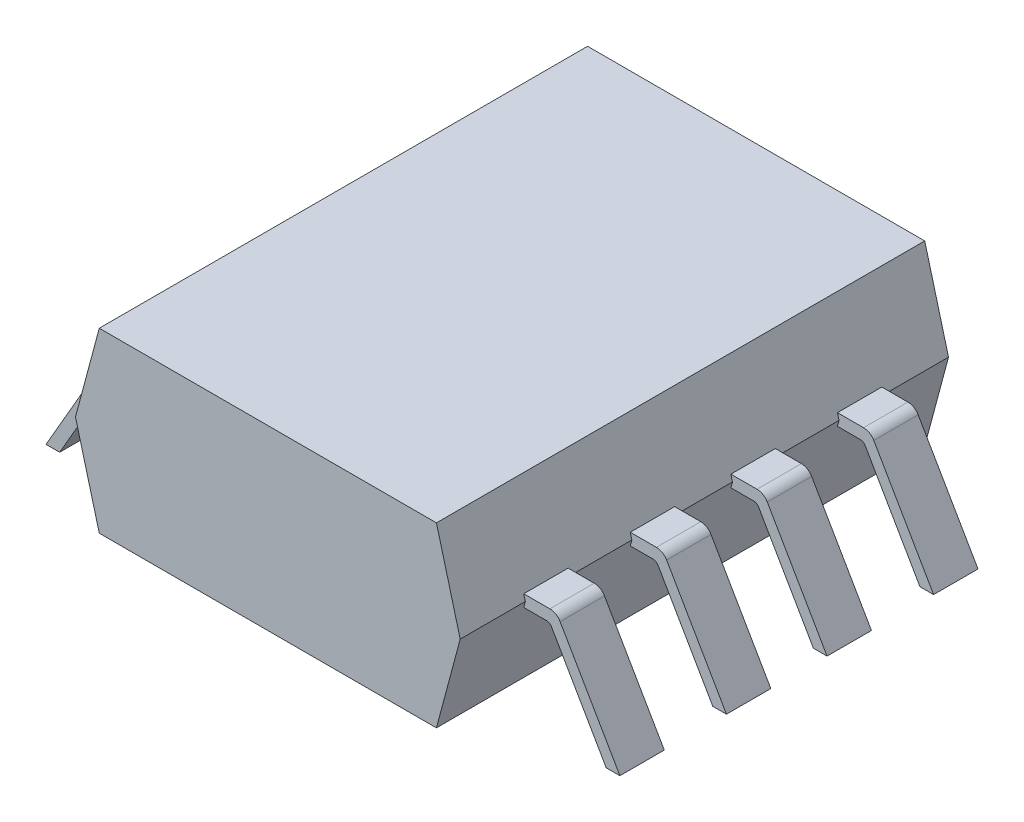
ISO-10303-21;
HEADER;
FILE_DESCRIPTION(('STEP AP214'),'2;1');
FILE_NAME('part.step','',(''),(''),'','','');
FILE_SCHEMA(('AUTOMOTIVE_DESIGN { 1 0 10303 214 1 1 1 1 }'));
ENDSEC;
DATA;
#1=APPLICATION_CONTEXT('core data for automotive mechanical design processes');
#2=APPLICATION_PROTOCOL_DEFINITION('international standard','automotive_design',2000,#1);
#3=PRODUCT_CONTEXT('',#1,'mechanical');
#4=PRODUCT('Part','Part','',(#3));
#5=PRODUCT_RELATED_PRODUCT_CATEGORY('part','',(#4));
#6=PRODUCT_DEFINITION_FORMATION('','',#4);
#7=PRODUCT_DEFINITION_CONTEXT('part definition',#1,'design');
#8=PRODUCT_DEFINITION('design','',#6,#7);
#9=PRODUCT_DEFINITION_SHAPE('','',#8);
#10=(LENGTH_UNIT() NAMED_UNIT(*) SI_UNIT(.MILLI.,.METRE.));
#11=(NAMED_UNIT(*) PLANE_ANGLE_UNIT() SI_UNIT($,.RADIAN.));
#12=(NAMED_UNIT(*) SI_UNIT($,.STERADIAN.) SOLID_ANGLE_UNIT());
#13=UNCERTAINTY_MEASURE_WITH_UNIT(LENGTH_MEASURE(1.E-05),#10,'distance_accuracy_value','');
#14=(GEOMETRIC_REPRESENTATION_CONTEXT(3) GLOBAL_UNCERTAINTY_ASSIGNED_CONTEXT((#13)) GLOBAL_UNIT_ASSIGNED_CONTEXT((#10,
#11,#12)) REPRESENTATION_CONTEXT('',''));
#15=CARTESIAN_POINT('',(0.,0.,0.));
#16=DIRECTION('',(0.,0.,1.));
#17=DIRECTION('',(1.,0.,0.));
#18=AXIS2_PLACEMENT_3D('',#15,#16,#17);
#19=CARTESIAN_POINT('',(-44.4718083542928,6.83933091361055,42.0715958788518));
#20=DIRECTION('',(0.965925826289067,0.258819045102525,0.));
#21=DIRECTION('',(-0.258819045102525,0.965925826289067,0.));
#22=AXIS2_PLACEMENT_3D('',#19,#20,#21);
#23=PLANE('',#22);
#24=DIRECTION('',(0.258819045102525,-0.965925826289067,0.));
#25=VECTOR('',#24,1.);
#26=CARTESIAN_POINT('',(-44.4718083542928,6.83933091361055,33.8215958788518));
#27=LINE('',#26,#25);
#28=CARTESIAN_POINT('',(-44.8737321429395,8.33933091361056,33.8215958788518));
#29=VERTEX_POINT('',#28);
#30=CARTESIAN_POINT('',(-44.4718083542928,6.83933091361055,33.8215958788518));
#31=VERTEX_POINT('',#30);
#32=EDGE_CURVE('E704',#29,#31,#27,.T.);
#33=ORIENTED_EDGE('',*,*,#32,.T.);
#34=DIRECTION('',(0.,0.,-1.));
#35=VECTOR('',#34,1.);
#36=CARTESIAN_POINT('',(-44.4718083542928,6.83933091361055,42.0715958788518));
#37=LINE('',#36,#35);
#38=CARTESIAN_POINT('',(-44.4718083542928,6.83933091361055,42.0715958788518));
#39=VERTEX_POINT('',#38);
#40=EDGE_CURVE('E1012',#39,#31,#37,.T.);
#41=ORIENTED_EDGE('',*,*,#40,.F.);
#42=DIRECTION('',(0.258819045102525,-0.965925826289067,0.));
#43=VECTOR('',#42,1.);
#44=CARTESIAN_POINT('',(-44.4718083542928,6.83933091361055,42.0715958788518));
#45=LINE('',#44,#43);
#46=CARTESIAN_POINT('',(-44.8737321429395,8.33933091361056,42.0715958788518));
#47=VERTEX_POINT('',#46);
#48=EDGE_CURVE('E983',#47,#39,#45,.T.);
#49=ORIENTED_EDGE('',*,*,#48,.F.);
#50=DIRECTION('',(0.,0.,-1.));
#51=VECTOR('',#50,1.);
#52=CARTESIAN_POINT('',(-44.8737321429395,8.33933091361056,42.0715958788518));
#53=LINE('',#52,#51);
#54=CARTESIAN_POINT('',(-44.8737321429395,8.33933091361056,40.9715958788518));
#55=VERTEX_POINT('',#54);
#56=EDGE_CURVE('E997',#47,#55,#53,.T.);
#57=ORIENTED_EDGE('',*,*,#56,.T.);
#58=DIRECTION('',(0.258819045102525,-0.965925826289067,0.));
#59=VECTOR('',#58,1.);
#60=CARTESIAN_POINT('',(-44.4718083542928,6.83933091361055,40.9715958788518));
#61=LINE('',#60,#59);
#62=CARTESIAN_POINT('',(-44.8469372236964,8.23933091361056,40.9715958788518));
#63=VERTEX_POINT('',#62);
#64=EDGE_CURVE('E980',#55,#63,#61,.T.);
#65=ORIENTED_EDGE('',*,*,#64,.T.);
#66=DIRECTION('',(0.,0.,-1.));
#67=VECTOR('',#66,1.);
#68=CARTESIAN_POINT('',(-44.8469372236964,8.23933091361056,40.9715958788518));
#69=LINE('',#68,#67);
#70=CARTESIAN_POINT('',(-44.8469372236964,8.23933091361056,40.2215958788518));
#71=VERTEX_POINT('',#70);
#72=EDGE_CURVE('E965',#63,#71,#69,.T.);
#73=ORIENTED_EDGE('',*,*,#72,.T.);
#74=DIRECTION('',(0.258819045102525,-0.965925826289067,0.));
#75=VECTOR('',#74,1.);
#76=CARTESIAN_POINT('',(-44.4718083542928,6.83933091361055,40.2215958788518));
#77=LINE('',#76,#75);
#78=CARTESIAN_POINT('',(-44.8737321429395,8.33933091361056,40.2215958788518));
#79=VERTEX_POINT('',#78);
#80=EDGE_CURVE('E977',#79,#71,#77,.T.);
#81=ORIENTED_EDGE('',*,*,#80,.F.);
#82=CARTESIAN_POINT('',(-44.8737321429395,8.33933091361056,39.1715958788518));
#83=VERTEX_POINT('',#82);
#84=EDGE_CURVE('E1001',#79,#83,#53,.T.);
#85=ORIENTED_EDGE('',*,*,#84,.T.);
#86=DIRECTION('',(-0.258819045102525,0.965925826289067,0.));
#87=VECTOR('',#86,1.);
#88=CARTESIAN_POINT('',(-44.4718083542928,6.83933091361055,39.1715958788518));
#89=LINE('',#88,#87);
#90=CARTESIAN_POINT('',(-44.8469372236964,8.23933091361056,39.1715958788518));
#91=VERTEX_POINT('',#90);
#92=EDGE_CURVE('E936',#91,#83,#89,.T.);
#93=ORIENTED_EDGE('',*,*,#92,.F.);
#94=DIRECTION('',(0.,0.,1.));
#95=VECTOR('',#94,1.);
#96=CARTESIAN_POINT('',(-44.8469372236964,8.23933091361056,38.4215958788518));
#97=LINE('',#96,#95);
#98=CARTESIAN_POINT('',(-44.8469372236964,8.23933091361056,38.4215958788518));
#99=VERTEX_POINT('',#98);
#100=EDGE_CURVE('E934',#99,#91,#97,.T.);
#101=ORIENTED_EDGE('',*,*,#100,.F.);
#102=DIRECTION('',(-0.258819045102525,0.965925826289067,0.));
#103=VECTOR('',#102,1.);
#104=CARTESIAN_POINT('',(-44.4718083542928,6.83933091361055,38.4215958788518));
#105=LINE('',#104,#103);
#106=CARTESIAN_POINT('',(-44.8737321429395,8.33933091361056,38.4215958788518));
#107=VERTEX_POINT('',#106);
#108=EDGE_CURVE('E939',#99,#107,#105,.T.);
#109=ORIENTED_EDGE('',*,*,#108,.T.);
#110=CARTESIAN_POINT('',(-44.8737321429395,8.33933091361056,37.4715958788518));
#111=VERTEX_POINT('',#110);
#112=EDGE_CURVE('E996',#107,#111,#53,.T.);
#113=ORIENTED_EDGE('',*,*,#112,.T.);
#114=DIRECTION('',(0.258819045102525,-0.965925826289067,0.));
#115=VECTOR('',#114,1.);
#116=CARTESIAN_POINT('',(-44.4718083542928,6.83933091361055,37.4715958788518));
#117=LINE('',#116,#115);
#118=CARTESIAN_POINT('',(-44.8469372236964,8.23933091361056,37.4715958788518));
#119=VERTEX_POINT('',#118);
#120=EDGE_CURVE('E701',#111,#119,#117,.T.);
#121=ORIENTED_EDGE('',*,*,#120,.T.);
#122=DIRECTION('',(0.,0.,-1.));
#123=VECTOR('',#122,1.);
#124=CARTESIAN_POINT('',(-44.8469372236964,8.23933091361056,37.4715958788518));
#125=LINE('',#124,#123);
#126=CARTESIAN_POINT('',(-44.8469372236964,8.23933091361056,36.7215958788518));
#127=VERTEX_POINT('',#126);
#128=EDGE_CURVE('E688',#119,#127,#125,.T.);
#129=ORIENTED_EDGE('',*,*,#128,.T.);
#130=DIRECTION('',(0.258819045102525,-0.965925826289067,0.));
#131=VECTOR('',#130,1.);
#132=CARTESIAN_POINT('',(-44.4718083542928,6.83933091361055,36.7215958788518));
#133=LINE('',#132,#131);
#134=CARTESIAN_POINT('',(-44.8737321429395,8.33933091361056,36.7215958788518));
#135=VERTEX_POINT('',#134);
#136=EDGE_CURVE('E698',#135,#127,#133,.T.);
#137=ORIENTED_EDGE('',*,*,#136,.F.);
#138=DIRECTION('',(0.,0.,-1.));
#139=VECTOR('',#138,1.);
#140=CARTESIAN_POINT('',(-44.8737321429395,8.33933091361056,38.5715958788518));
#141=LINE('',#140,#139);
#142=CARTESIAN_POINT('',(-44.8737321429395,8.33933091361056,35.6715958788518));
#143=VERTEX_POINT('',#142);
#144=EDGE_CURVE('E724',#135,#143,#141,.T.);
#145=ORIENTED_EDGE('',*,*,#144,.T.);
#146=DIRECTION('',(-0.258819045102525,0.965925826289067,0.));
#147=VECTOR('',#146,1.);
#148=CARTESIAN_POINT('',(-44.4718083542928,6.83933091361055,35.6715958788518));
#149=LINE('',#148,#147);
#150=CARTESIAN_POINT('',(-44.8469372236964,8.23933091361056,35.6715958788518));
#151=VERTEX_POINT('',#150);
#152=EDGE_CURVE('E658',#151,#143,#149,.T.);
#153=ORIENTED_EDGE('',*,*,#152,.F.);
#154=DIRECTION('',(0.,0.,1.));
#155=VECTOR('',#154,1.);
#156=CARTESIAN_POINT('',(-44.8469372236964,8.23933091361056,34.9215958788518));
#157=LINE('',#156,#155);
#158=CARTESIAN_POINT('',(-44.8469372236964,8.23933091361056,34.9215958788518));
#159=VERTEX_POINT('',#158);
#160=EDGE_CURVE('E655',#159,#151,#157,.T.);
#161=ORIENTED_EDGE('',*,*,#160,.F.);
#162=DIRECTION('',(-0.258819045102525,0.965925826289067,0.));
#163=VECTOR('',#162,1.);
#164=CARTESIAN_POINT('',(-44.4718083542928,6.83933091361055,34.9215958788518));
#165=LINE('',#164,#163);
#166=CARTESIAN_POINT('',(-44.8737321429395,8.33933091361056,34.9215958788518));
#167=VERTEX_POINT('',#166);
#168=EDGE_CURVE('E661',#159,#167,#165,.T.);
#169=ORIENTED_EDGE('',*,*,#168,.T.);
#170=EDGE_CURVE('E722',#167,#29,#141,.T.);
#171=ORIENTED_EDGE('',*,*,#170,.T.);
#172=EDGE_LOOP('',(#33,#41,#49,#57,#65,#73,#81,#85,#93,#101,#109,#113,#121,#129,#137,#145,#153,
#161,#169,#171));
#173=FACE_BOUND('',#172,.T.);
#174=ADVANCED_FACE('F40',(#173),#23,.F.);
#175=CARTESIAN_POINT('',(-44.4718083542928,6.83933091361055,42.0715958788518));
#176=DIRECTION('',(0.,1.,0.));
#177=DIRECTION('',(0.,0.,1.));
#178=AXIS2_PLACEMENT_3D('',#175,#176,#177);
#179=PLANE('',#178);
#180=DIRECTION('',(1.,0.,0.));
#181=VECTOR('',#180,1.);
#182=CARTESIAN_POINT('',(-44.4718083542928,6.83933091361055,33.8215958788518));
#183=LINE('',#182,#181);
#184=CARTESIAN_POINT('',(-38.7756559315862,6.83933091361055,33.8215958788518));
#185=VERTEX_POINT('',#184);
#186=EDGE_CURVE('E707',#31,#185,#183,.T.);
#187=ORIENTED_EDGE('',*,*,#186,.T.);
#188=DIRECTION('',(0.,0.,-1.));
#189=VECTOR('',#188,1.);
#190=CARTESIAN_POINT('',(-38.7756559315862,6.83933091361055,42.0715958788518));
#191=LINE('',#190,#189);
#192=CARTESIAN_POINT('',(-38.7756559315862,6.83933091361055,42.0715958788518));
#193=VERTEX_POINT('',#192);
#194=EDGE_CURVE('E1009',#193,#185,#191,.T.);
#195=ORIENTED_EDGE('',*,*,#194,.F.);
#196=DIRECTION('',(1.,0.,0.));
#197=VECTOR('',#196,1.);
#198=CARTESIAN_POINT('',(-44.4718083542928,6.83933091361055,42.0715958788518));
#199=LINE('',#198,#197);
#200=EDGE_CURVE('E986',#39,#193,#199,.T.);
#201=ORIENTED_EDGE('',*,*,#200,.F.);
#202=ORIENTED_EDGE('',*,*,#40,.T.);
#203=EDGE_LOOP('',(#187,#195,#201,#202));
#204=FACE_BOUND('',#203,.T.);
#205=ADVANCED_FACE('F1209',(#204),#179,.F.);
#206=CARTESIAN_POINT('',(-38.7756559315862,6.83933091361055,42.0715958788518));
#207=DIRECTION('',(-0.965925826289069,0.258819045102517,0.));
#208=DIRECTION('',(-0.258819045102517,-0.965925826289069,0.));
#209=AXIS2_PLACEMENT_3D('',#206,#207,#208);
#210=PLANE('',#209);
#211=DIRECTION('',(0.,0.,1.));
#212=VECTOR('',#211,1.);
#213=CARTESIAN_POINT('',(-38.4005270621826,8.23933091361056,38.4215958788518));
#214=LINE('',#213,#212);
#215=CARTESIAN_POINT('',(-38.4005270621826,8.23933091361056,38.4215958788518));
#216=VERTEX_POINT('',#215);
#217=CARTESIAN_POINT('',(-38.4005270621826,8.23933091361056,39.1715958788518));
#218=VERTEX_POINT('',#217);
#219=EDGE_CURVE('E843',#216,#218,#214,.T.);
#220=ORIENTED_EDGE('',*,*,#219,.T.);
#221=DIRECTION('',(-0.258819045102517,-0.965925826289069,0.));
#222=VECTOR('',#221,1.);
#223=CARTESIAN_POINT('',(-38.7756559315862,6.83933091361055,39.1715958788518));
#224=LINE('',#223,#222);
#225=CARTESIAN_POINT('',(-38.3737321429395,8.33933091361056,39.1715958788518));
#226=VERTEX_POINT('',#225);
#227=EDGE_CURVE('E853',#226,#218,#224,.T.);
#228=ORIENTED_EDGE('',*,*,#227,.F.);
#229=DIRECTION('',(0.,0.,-1.));
#230=VECTOR('',#229,1.);
#231=CARTESIAN_POINT('',(-38.3737321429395,8.33933091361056,42.0715958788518));
#232=LINE('',#231,#230);
#233=CARTESIAN_POINT('',(-38.3737321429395,8.33933091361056,40.2215958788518));
#234=VERTEX_POINT('',#233);
#235=EDGE_CURVE('E1010',#234,#226,#232,.T.);
#236=ORIENTED_EDGE('',*,*,#235,.F.);
#237=DIRECTION('',(0.258819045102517,0.965925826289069,0.));
#238=VECTOR('',#237,1.);
#239=CARTESIAN_POINT('',(-38.7756559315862,6.83933091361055,40.2215958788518));
#240=LINE('',#239,#238);
#241=CARTESIAN_POINT('',(-38.4005270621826,8.23933091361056,40.2215958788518));
#242=VERTEX_POINT('',#241);
#243=EDGE_CURVE('E895',#242,#234,#240,.T.);
#244=ORIENTED_EDGE('',*,*,#243,.F.);
#245=DIRECTION('',(0.,0.,-1.));
#246=VECTOR('',#245,1.);
#247=CARTESIAN_POINT('',(-38.4005270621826,8.23933091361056,40.9715958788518));
#248=LINE('',#247,#246);
#249=CARTESIAN_POINT('',(-38.4005270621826,8.23933091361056,40.9715958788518));
#250=VERTEX_POINT('',#249);
#251=EDGE_CURVE('E892',#250,#242,#248,.T.);
#252=ORIENTED_EDGE('',*,*,#251,.F.);
#253=DIRECTION('',(0.258819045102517,0.965925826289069,0.));
#254=VECTOR('',#253,1.);
#255=CARTESIAN_POINT('',(-38.7756559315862,6.83933091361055,40.9715958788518));
#256=LINE('',#255,#254);
#257=CARTESIAN_POINT('',(-38.3737321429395,8.33933091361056,40.9715958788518));
#258=VERTEX_POINT('',#257);
#259=EDGE_CURVE('E898',#250,#258,#256,.T.);
#260=ORIENTED_EDGE('',*,*,#259,.T.);
#261=CARTESIAN_POINT('',(-38.3737321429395,8.33933091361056,42.0715958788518));
#262=VERTEX_POINT('',#261);
#263=EDGE_CURVE('E1006',#262,#258,#232,.T.);
#264=ORIENTED_EDGE('',*,*,#263,.F.);
#265=DIRECTION('',(0.258819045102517,0.965925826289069,0.));
#266=VECTOR('',#265,1.);
#267=CARTESIAN_POINT('',(-38.7756559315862,6.83933091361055,42.0715958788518));
#268=LINE('',#267,#266);
#269=EDGE_CURVE('E988',#193,#262,#268,.T.);
#270=ORIENTED_EDGE('',*,*,#269,.F.);
#271=ORIENTED_EDGE('',*,*,#194,.T.);
#272=DIRECTION('',(0.258819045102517,0.965925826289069,0.));
#273=VECTOR('',#272,1.);
#274=CARTESIAN_POINT('',(-38.7756559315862,6.83933091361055,33.8215958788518));
#275=LINE('',#274,#273);
#276=CARTESIAN_POINT('',(-38.3737321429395,8.33933091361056,33.8215958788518));
#277=VERTEX_POINT('',#276);
#278=EDGE_CURVE('E710',#185,#277,#275,.T.);
#279=ORIENTED_EDGE('',*,*,#278,.T.);
#280=DIRECTION('',(0.,0.,-1.));
#281=VECTOR('',#280,1.);
#282=CARTESIAN_POINT('',(-38.3737321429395,8.33933091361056,38.5715958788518));
#283=LINE('',#282,#281);
#284=CARTESIAN_POINT('',(-38.3737321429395,8.33933091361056,34.9215958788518));
#285=VERTEX_POINT('',#284);
#286=EDGE_CURVE('E725',#285,#277,#283,.T.);
#287=ORIENTED_EDGE('',*,*,#286,.F.);
#288=DIRECTION('',(-0.258819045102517,-0.965925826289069,0.));
#289=VECTOR('',#288,1.);
#290=CARTESIAN_POINT('',(-38.7756559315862,6.83933091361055,34.9215958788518));
#291=LINE('',#290,#289);
#292=CARTESIAN_POINT('',(-38.4005270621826,8.23933091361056,34.9215958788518));
#293=VERTEX_POINT('',#292);
#294=EDGE_CURVE('E577',#285,#293,#291,.T.);
#295=ORIENTED_EDGE('',*,*,#294,.T.);
#296=DIRECTION('',(0.,0.,1.));
#297=VECTOR('',#296,1.);
#298=CARTESIAN_POINT('',(-38.4005270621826,8.23933091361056,34.9215958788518));
#299=LINE('',#298,#297);
#300=CARTESIAN_POINT('',(-38.4005270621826,8.23933091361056,35.6715958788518));
#301=VERTEX_POINT('',#300);
#302=EDGE_CURVE('E568',#293,#301,#299,.T.);
#303=ORIENTED_EDGE('',*,*,#302,.T.);
#304=DIRECTION('',(-0.258819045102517,-0.965925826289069,0.));
#305=VECTOR('',#304,1.);
#306=CARTESIAN_POINT('',(-38.7756559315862,6.83933091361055,35.6715958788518));
#307=LINE('',#306,#305);
#308=CARTESIAN_POINT('',(-38.3737321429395,8.33933091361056,35.6715958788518));
#309=VERTEX_POINT('',#308);
#310=EDGE_CURVE('E574',#309,#301,#307,.T.);
#311=ORIENTED_EDGE('',*,*,#310,.F.);
#312=CARTESIAN_POINT('',(-38.3737321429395,8.33933091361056,36.7215958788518));
#313=VERTEX_POINT('',#312);
#314=EDGE_CURVE('E727',#313,#309,#283,.T.);
#315=ORIENTED_EDGE('',*,*,#314,.F.);
#316=DIRECTION('',(0.258819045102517,0.965925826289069,0.));
#317=VECTOR('',#316,1.);
#318=CARTESIAN_POINT('',(-38.7756559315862,6.83933091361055,36.7215958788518));
#319=LINE('',#318,#317);
#320=CARTESIAN_POINT('',(-38.4005270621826,8.23933091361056,36.7215958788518));
#321=VERTEX_POINT('',#320);
#322=EDGE_CURVE('E616',#321,#313,#319,.T.);
#323=ORIENTED_EDGE('',*,*,#322,.F.);
#324=DIRECTION('',(0.,0.,-1.));
#325=VECTOR('',#324,1.);
#326=CARTESIAN_POINT('',(-38.4005270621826,8.23933091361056,37.4715958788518));
#327=LINE('',#326,#325);
#328=CARTESIAN_POINT('',(-38.4005270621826,8.23933091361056,37.4715958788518));
#329=VERTEX_POINT('',#328);
#330=EDGE_CURVE('E614',#329,#321,#327,.T.);
#331=ORIENTED_EDGE('',*,*,#330,.F.);
#332=DIRECTION('',(0.258819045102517,0.965925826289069,0.));
#333=VECTOR('',#332,1.);
#334=CARTESIAN_POINT('',(-38.7756559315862,6.83933091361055,37.4715958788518));
#335=LINE('',#334,#333);
#336=CARTESIAN_POINT('',(-38.3737321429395,8.33933091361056,37.4715958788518));
#337=VERTEX_POINT('',#336);
#338=EDGE_CURVE('E619',#329,#337,#335,.T.);
#339=ORIENTED_EDGE('',*,*,#338,.T.);
#340=CARTESIAN_POINT('',(-38.3737321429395,8.33933091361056,38.4215958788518));
#341=VERTEX_POINT('',#340);
#342=EDGE_CURVE('E1005',#341,#337,#232,.T.);
#343=ORIENTED_EDGE('',*,*,#342,.F.);
#344=DIRECTION('',(-0.258819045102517,-0.965925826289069,0.));
#345=VECTOR('',#344,1.);
#346=CARTESIAN_POINT('',(-38.7756559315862,6.83933091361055,38.4215958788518));
#347=LINE('',#346,#345);
#348=EDGE_CURVE('E856',#341,#216,#347,.T.);
#349=ORIENTED_EDGE('',*,*,#348,.T.);
#350=EDGE_LOOP('',(#220,#228,#236,#244,#252,#260,#264,#270,#271,#279,#287,#295,#303,#311,#315,
#323,#331,#339,#343,#349));
#351=FACE_BOUND('',#350,.T.);
#352=ADVANCED_FACE('F1121',(#351),#210,.F.);
#353=CARTESIAN_POINT('',(-38.7756559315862,9.83933091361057,42.0715958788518));
#354=DIRECTION('',(-0.965925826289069,-0.258819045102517,0.));
#355=DIRECTION('',(0.258819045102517,-0.965925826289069,0.));
#356=AXIS2_PLACEMENT_3D('',#353,#354,#355);
#357=PLANE('',#356);
#358=DIRECTION('',(-0.258819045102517,0.965925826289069,0.));
#359=VECTOR('',#358,1.);
#360=CARTESIAN_POINT('',(-38.7756559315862,9.83933091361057,33.8215958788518));
#361=LINE('',#360,#359);
#362=CARTESIAN_POINT('',(-38.7756559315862,9.83933091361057,33.8215958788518));
#363=VERTEX_POINT('',#362);
#364=EDGE_CURVE('E713',#277,#363,#361,.T.);
#365=ORIENTED_EDGE('',*,*,#364,.T.);
#366=DIRECTION('',(0.,0.,-1.));
#367=VECTOR('',#366,1.);
#368=CARTESIAN_POINT('',(-38.7756559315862,9.83933091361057,42.0715958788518));
#369=LINE('',#368,#367);
#370=CARTESIAN_POINT('',(-38.7756559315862,9.83933091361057,42.0715958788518));
#371=VERTEX_POINT('',#370);
#372=EDGE_CURVE('E1003',#371,#363,#369,.T.);
#373=ORIENTED_EDGE('',*,*,#372,.F.);
#374=DIRECTION('',(-0.258819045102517,0.965925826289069,0.));
#375=VECTOR('',#374,1.);
#376=CARTESIAN_POINT('',(-38.7756559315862,9.83933091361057,42.0715958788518));
#377=LINE('',#376,#375);
#378=EDGE_CURVE('E990',#262,#371,#377,.T.);
#379=ORIENTED_EDGE('',*,*,#378,.F.);
#380=ORIENTED_EDGE('',*,*,#263,.T.);
#381=DIRECTION('',(-0.258819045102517,0.965925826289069,0.));
#382=VECTOR('',#381,1.);
#383=CARTESIAN_POINT('',(-38.7756559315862,9.83933091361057,40.9715958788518));
#384=LINE('',#383,#382);
#385=CARTESIAN_POINT('',(-38.4005270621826,8.43933091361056,40.9715958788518));
#386=VERTEX_POINT('',#385);
#387=EDGE_CURVE('E1063',#258,#386,#384,.T.);
#388=ORIENTED_EDGE('',*,*,#387,.T.);
#389=DIRECTION('',(0.,0.,-1.));
#390=VECTOR('',#389,1.);
#391=CARTESIAN_POINT('',(-38.4005270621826,8.43933091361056,40.9715958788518));
#392=LINE('',#391,#390);
#393=CARTESIAN_POINT('',(-38.4005270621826,8.43933091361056,40.2215958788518));
#394=VERTEX_POINT('',#393);
#395=EDGE_CURVE('E885',#386,#394,#392,.T.);
#396=ORIENTED_EDGE('',*,*,#395,.T.);
#397=DIRECTION('',(-0.258819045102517,0.965925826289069,0.));
#398=VECTOR('',#397,1.);
#399=CARTESIAN_POINT('',(-38.7756559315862,9.83933091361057,40.2215958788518));
#400=LINE('',#399,#398);
#401=EDGE_CURVE('E1060',#234,#394,#400,.T.);
#402=ORIENTED_EDGE('',*,*,#401,.F.);
#403=ORIENTED_EDGE('',*,*,#235,.T.);
#404=DIRECTION('',(0.258819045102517,-0.965925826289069,0.));
#405=VECTOR('',#404,1.);
#406=CARTESIAN_POINT('',(-38.7756559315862,9.83933091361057,39.1715958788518));
#407=LINE('',#406,#405);
#408=CARTESIAN_POINT('',(-38.4005270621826,8.43933091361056,39.1715958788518));
#409=VERTEX_POINT('',#408);
#410=EDGE_CURVE('E1083',#409,#226,#407,.T.);
#411=ORIENTED_EDGE('',*,*,#410,.F.);
#412=DIRECTION('',(0.,0.,1.));
#413=VECTOR('',#412,1.);
#414=CARTESIAN_POINT('',(-38.4005270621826,8.43933091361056,38.4215958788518));
#415=LINE('',#414,#413);
#416=CARTESIAN_POINT('',(-38.4005270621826,8.43933091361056,38.4215958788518));
#417=VERTEX_POINT('',#416);
#418=EDGE_CURVE('E851',#417,#409,#415,.T.);
#419=ORIENTED_EDGE('',*,*,#418,.F.);
#420=DIRECTION('',(0.258819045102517,-0.965925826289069,0.));
#421=VECTOR('',#420,1.);
#422=CARTESIAN_POINT('',(-38.7756559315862,9.83933091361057,38.4215958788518));
#423=LINE('',#422,#421);
#424=EDGE_CURVE('E1086',#417,#341,#423,.T.);
#425=ORIENTED_EDGE('',*,*,#424,.T.);
#426=ORIENTED_EDGE('',*,*,#342,.T.);
#427=DIRECTION('',(-0.258819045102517,0.965925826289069,0.));
#428=VECTOR('',#427,1.);
#429=CARTESIAN_POINT('',(-38.7756559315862,9.83933091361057,37.4715958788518));
#430=LINE('',#429,#428);
#431=CARTESIAN_POINT('',(-38.4005270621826,8.43933091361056,37.4715958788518));
#432=VERTEX_POINT('',#431);
#433=EDGE_CURVE('E778',#337,#432,#430,.T.);
#434=ORIENTED_EDGE('',*,*,#433,.T.);
#435=DIRECTION('',(0.,0.,-1.));
#436=VECTOR('',#435,1.);
#437=CARTESIAN_POINT('',(-38.4005270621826,8.43933091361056,37.4715958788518));
#438=LINE('',#437,#436);
#439=CARTESIAN_POINT('',(-38.4005270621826,8.43933091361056,36.7215958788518));
#440=VERTEX_POINT('',#439);
#441=EDGE_CURVE('E607',#432,#440,#438,.T.);
#442=ORIENTED_EDGE('',*,*,#441,.T.);
#443=DIRECTION('',(-0.258819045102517,0.965925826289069,0.));
#444=VECTOR('',#443,1.);
#445=CARTESIAN_POINT('',(-38.7756559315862,9.83933091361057,36.7215958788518));
#446=LINE('',#445,#444);
#447=EDGE_CURVE('E775',#313,#440,#446,.T.);
#448=ORIENTED_EDGE('',*,*,#447,.F.);
#449=ORIENTED_EDGE('',*,*,#314,.T.);
#450=DIRECTION('',(0.258819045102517,-0.965925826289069,0.));
#451=VECTOR('',#450,1.);
#452=CARTESIAN_POINT('',(-38.7756559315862,9.83933091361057,35.6715958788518));
#453=LINE('',#452,#451);
#454=CARTESIAN_POINT('',(-38.4005270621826,8.43933091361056,35.6715958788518));
#455=VERTEX_POINT('',#454);
#456=EDGE_CURVE('E799',#455,#309,#453,.T.);
#457=ORIENTED_EDGE('',*,*,#456,.F.);
#458=DIRECTION('',(0.,0.,1.));
#459=VECTOR('',#458,1.);
#460=CARTESIAN_POINT('',(-38.4005270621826,8.43933091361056,34.9215958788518));
#461=LINE('',#460,#459);
#462=CARTESIAN_POINT('',(-38.4005270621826,8.43933091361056,34.9215958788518));
#463=VERTEX_POINT('',#462);
#464=EDGE_CURVE('E544',#463,#455,#461,.T.);
#465=ORIENTED_EDGE('',*,*,#464,.F.);
#466=DIRECTION('',(0.258819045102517,-0.965925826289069,0.));
#467=VECTOR('',#466,1.);
#468=CARTESIAN_POINT('',(-38.7756559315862,9.83933091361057,34.9215958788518));
#469=LINE('',#468,#467);
#470=EDGE_CURVE('E802',#463,#285,#469,.T.);
#471=ORIENTED_EDGE('',*,*,#470,.T.);
#472=ORIENTED_EDGE('',*,*,#286,.T.);
#473=EDGE_LOOP('',(#365,#373,#379,#380,#388,#396,#402,#403,#411,#419,#425,#426,#434,#442,#448,
#449,#457,#465,#471,#472));
#474=FACE_BOUND('',#473,.T.);
#475=ADVANCED_FACE('F1130',(#474),#357,.F.);
#476=CARTESIAN_POINT('',(-44.4718083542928,9.83933091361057,42.0715958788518));
#477=DIRECTION('',(0.,-1.,0.));
#478=DIRECTION('',(0.,0.,-1.));
#479=AXIS2_PLACEMENT_3D('',#476,#477,#478);
#480=PLANE('',#479);
#481=DIRECTION('',(-1.,0.,0.));
#482=VECTOR('',#481,1.);
#483=CARTESIAN_POINT('',(-44.4718083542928,9.83933091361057,33.8215958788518));
#484=LINE('',#483,#482);
#485=CARTESIAN_POINT('',(-44.4718083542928,9.83933091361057,33.8215958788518));
#486=VERTEX_POINT('',#485);
#487=EDGE_CURVE('E716',#363,#486,#484,.T.);
#488=ORIENTED_EDGE('',*,*,#487,.T.);
#489=DIRECTION('',(0.,0.,-1.));
#490=VECTOR('',#489,1.);
#491=CARTESIAN_POINT('',(-44.4718083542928,9.83933091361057,42.0715958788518));
#492=LINE('',#491,#490);
#493=CARTESIAN_POINT('',(-44.4718083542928,9.83933091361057,42.0715958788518));
#494=VERTEX_POINT('',#493);
#495=EDGE_CURVE('E1000',#494,#486,#492,.T.);
#496=ORIENTED_EDGE('',*,*,#495,.F.);
#497=DIRECTION('',(-1.,0.,0.));
#498=VECTOR('',#497,1.);
#499=CARTESIAN_POINT('',(-44.4718083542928,9.83933091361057,42.0715958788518));
#500=LINE('',#499,#498);
#501=EDGE_CURVE('E992',#371,#494,#500,.T.);
#502=ORIENTED_EDGE('',*,*,#501,.F.);
#503=ORIENTED_EDGE('',*,*,#372,.T.);
#504=EDGE_LOOP('',(#488,#496,#502,#503));
#505=FACE_BOUND('',#504,.T.);
#506=ADVANCED_FACE('F1350',(#505),#480,.F.);
#507=CARTESIAN_POINT('',(-44.4718083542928,9.83933091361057,42.0715958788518));
#508=DIRECTION('',(0.965925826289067,-0.258819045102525,0.));
#509=DIRECTION('',(0.258819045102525,0.965925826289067,0.));
#510=AXIS2_PLACEMENT_3D('',#507,#508,#509);
#511=PLANE('',#510);
#512=DIRECTION('',(0.,0.,1.));
#513=VECTOR('',#512,1.);
#514=CARTESIAN_POINT('',(-44.8469372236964,8.43933091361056,38.4215958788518));
#515=LINE('',#514,#513);
#516=CARTESIAN_POINT('',(-44.8469372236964,8.43933091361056,38.4215958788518));
#517=VERTEX_POINT('',#516);
#518=CARTESIAN_POINT('',(-44.8469372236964,8.43933091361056,39.1715958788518));
#519=VERTEX_POINT('',#518);
#520=EDGE_CURVE('E927',#517,#519,#515,.T.);
#521=ORIENTED_EDGE('',*,*,#520,.T.);
#522=DIRECTION('',(0.258819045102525,0.965925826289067,0.));
#523=VECTOR('',#522,1.);
#524=CARTESIAN_POINT('',(-44.4718083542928,9.83933091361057,39.1715958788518));
#525=LINE('',#524,#523);
#526=EDGE_CURVE('E1037',#83,#519,#525,.T.);
#527=ORIENTED_EDGE('',*,*,#526,.F.);
#528=ORIENTED_EDGE('',*,*,#84,.F.);
#529=DIRECTION('',(-0.258819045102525,-0.965925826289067,0.));
#530=VECTOR('',#529,1.);
#531=CARTESIAN_POINT('',(-44.4718083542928,9.83933091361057,40.2215958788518));
#532=LINE('',#531,#530);
#533=CARTESIAN_POINT('',(-44.8469372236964,8.43933091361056,40.2215958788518));
#534=VERTEX_POINT('',#533);
#535=EDGE_CURVE('E1014',#534,#79,#532,.T.);
#536=ORIENTED_EDGE('',*,*,#535,.F.);
#537=DIRECTION('',(0.,0.,-1.));
#538=VECTOR('',#537,1.);
#539=CARTESIAN_POINT('',(-44.8469372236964,8.43933091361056,40.9715958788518));
#540=LINE('',#539,#538);
#541=CARTESIAN_POINT('',(-44.8469372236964,8.43933091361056,40.9715958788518));
#542=VERTEX_POINT('',#541);
#543=EDGE_CURVE('E974',#542,#534,#540,.T.);
#544=ORIENTED_EDGE('',*,*,#543,.F.);
#545=DIRECTION('',(-0.258819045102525,-0.965925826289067,0.));
#546=VECTOR('',#545,1.);
#547=CARTESIAN_POINT('',(-44.4718083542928,9.83933091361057,40.9715958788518));
#548=LINE('',#547,#546);
#549=EDGE_CURVE('E1017',#542,#55,#548,.T.);
#550=ORIENTED_EDGE('',*,*,#549,.T.);
#551=ORIENTED_EDGE('',*,*,#56,.F.);
#552=DIRECTION('',(-0.258819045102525,-0.965925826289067,0.));
#553=VECTOR('',#552,1.);
#554=CARTESIAN_POINT('',(-44.4718083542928,9.83933091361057,42.0715958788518));
#555=LINE('',#554,#553);
#556=EDGE_CURVE('E994',#494,#47,#555,.T.);
#557=ORIENTED_EDGE('',*,*,#556,.F.);
#558=ORIENTED_EDGE('',*,*,#495,.T.);
#559=DIRECTION('',(-0.258819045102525,-0.965925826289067,0.));
#560=VECTOR('',#559,1.);
#561=CARTESIAN_POINT('',(-44.4718083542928,9.83933091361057,33.8215958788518));
#562=LINE('',#561,#560);
#563=EDGE_CURVE('E719',#486,#29,#562,.T.);
#564=ORIENTED_EDGE('',*,*,#563,.T.);
#565=ORIENTED_EDGE('',*,*,#170,.F.);
#566=DIRECTION('',(0.258819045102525,0.965925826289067,0.));
#567=VECTOR('',#566,1.);
#568=CARTESIAN_POINT('',(-44.4718083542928,9.83933091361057,34.9215958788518));
#569=LINE('',#568,#567);
#570=CARTESIAN_POINT('',(-44.8469372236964,8.43933091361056,34.9215958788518));
#571=VERTEX_POINT('',#570);
#572=EDGE_CURVE('E755',#167,#571,#569,.T.);
#573=ORIENTED_EDGE('',*,*,#572,.T.);
#574=DIRECTION('',(0.,0.,1.));
#575=VECTOR('',#574,1.);
#576=CARTESIAN_POINT('',(-44.8469372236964,8.43933091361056,34.9215958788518));
#577=LINE('',#576,#575);
#578=CARTESIAN_POINT('',(-44.8469372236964,8.43933091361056,35.6715958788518));
#579=VERTEX_POINT('',#578);
#580=EDGE_CURVE('E648',#571,#579,#577,.T.);
#581=ORIENTED_EDGE('',*,*,#580,.T.);
#582=DIRECTION('',(0.258819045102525,0.965925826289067,0.));
#583=VECTOR('',#582,1.);
#584=CARTESIAN_POINT('',(-44.4718083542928,9.83933091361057,35.6715958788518));
#585=LINE('',#584,#583);
#586=EDGE_CURVE('E752',#143,#579,#585,.T.);
#587=ORIENTED_EDGE('',*,*,#586,.F.);
#588=ORIENTED_EDGE('',*,*,#144,.F.);
#589=DIRECTION('',(-0.258819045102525,-0.965925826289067,0.));
#590=VECTOR('',#589,1.);
#591=CARTESIAN_POINT('',(-44.4718083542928,9.83933091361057,36.7215958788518));
#592=LINE('',#591,#590);
#593=CARTESIAN_POINT('',(-44.8469372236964,8.43933091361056,36.7215958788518));
#594=VERTEX_POINT('',#593);
#595=EDGE_CURVE('E728',#594,#135,#592,.T.);
#596=ORIENTED_EDGE('',*,*,#595,.F.);
#597=DIRECTION('',(0.,0.,-1.));
#598=VECTOR('',#597,1.);
#599=CARTESIAN_POINT('',(-44.8469372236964,8.43933091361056,37.4715958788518));
#600=LINE('',#599,#598);
#601=CARTESIAN_POINT('',(-44.8469372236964,8.43933091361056,37.4715958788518));
#602=VERTEX_POINT('',#601);
#603=EDGE_CURVE('E696',#602,#594,#600,.T.);
#604=ORIENTED_EDGE('',*,*,#603,.F.);
#605=DIRECTION('',(-0.258819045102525,-0.965925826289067,0.));
#606=VECTOR('',#605,1.);
#607=CARTESIAN_POINT('',(-44.4718083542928,9.83933091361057,37.4715958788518));
#608=LINE('',#607,#606);
#609=EDGE_CURVE('E731',#602,#111,#608,.T.);
#610=ORIENTED_EDGE('',*,*,#609,.T.);
#611=ORIENTED_EDGE('',*,*,#112,.F.);
#612=DIRECTION('',(0.258819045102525,0.965925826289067,0.));
#613=VECTOR('',#612,1.);
#614=CARTESIAN_POINT('',(-44.4718083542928,9.83933091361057,38.4215958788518));
#615=LINE('',#614,#613);
#616=EDGE_CURVE('E1040',#107,#517,#615,.T.);
#617=ORIENTED_EDGE('',*,*,#616,.T.);
#618=EDGE_LOOP('',(#521,#527,#528,#536,#544,#550,#551,#557,#558,#564,#565,#573,#581,#587,#588,
#596,#604,#610,#611,#617));
#619=FACE_BOUND('',#618,.T.);
#620=ADVANCED_FACE('F1273',(#619),#511,.F.);
#621=CARTESIAN_POINT('',(-45.2756559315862,9.83933091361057,42.0715958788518));
#622=DIRECTION('',(0.,0.,-1.));
#623=DIRECTION('',(-1.,0.,0.));
#624=AXIS2_PLACEMENT_3D('',#621,#622,#623);
#625=PLANE('',#624);
#626=ORIENTED_EDGE('',*,*,#48,.T.);
#627=ORIENTED_EDGE('',*,*,#200,.T.);
#628=ORIENTED_EDGE('',*,*,#269,.T.);
#629=ORIENTED_EDGE('',*,*,#378,.T.);
#630=ORIENTED_EDGE('',*,*,#501,.T.);
#631=ORIENTED_EDGE('',*,*,#556,.T.);
#632=EDGE_LOOP('',(#626,#627,#628,#629,#630,#631));
#633=FACE_BOUND('',#632,.T.);
#634=ADVANCED_FACE('F1229',(#633),#625,.F.);
#635=CARTESIAN_POINT('',(-44.8469372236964,6.58933091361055,40.9715958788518));
#636=DIRECTION('',(0.,0.,1.));
#637=DIRECTION('',(1.,0.,0.));
#638=AXIS2_PLACEMENT_3D('',#635,#636,#637);
#639=PLANE('',#638);
#640=DIRECTION('',(-1.,0.,0.));
#641=VECTOR('',#640,1.);
#642=CARTESIAN_POINT('',(-44.8469372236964,8.43933091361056,40.9715958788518));
#643=LINE('',#642,#641);
#644=CARTESIAN_POINT('',(-45.288240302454,8.43933091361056,40.9715958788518));
#645=VERTEX_POINT('',#644);
#646=EDGE_CURVE('E953',#542,#645,#643,.T.);
#647=ORIENTED_EDGE('',*,*,#646,.T.);
#648=CARTESIAN_POINT('',(-45.288240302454,8.23933091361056,40.9715958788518));
#649=DIRECTION('',(0.,0.,1.));
#650=DIRECTION('',(1.,0.,0.));
#651=AXIS2_PLACEMENT_3D('',#648,#649,#650);
#652=CIRCLE('',#651,0.2);
#653=CARTESIAN_POINT('',(-45.4614453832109,8.33933091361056,40.9715958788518));
#654=VERTEX_POINT('',#653);
#655=EDGE_CURVE('E1031',#645,#654,#652,.T.);
#656=ORIENTED_EDGE('',*,*,#655,.T.);
#657=DIRECTION('',(-0.499999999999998,-0.86602540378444,0.));
#658=VECTOR('',#657,1.);
#659=CARTESIAN_POINT('',(-45.403710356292,8.43933091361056,40.9715958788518));
#660=LINE('',#659,#658);
#661=CARTESIAN_POINT('',(-46.4718083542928,6.58933091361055,40.9715958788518));
#662=VERTEX_POINT('',#661);
#663=EDGE_CURVE('E956',#654,#662,#660,.T.);
#664=ORIENTED_EDGE('',*,*,#663,.T.);
#665=DIRECTION('',(1.,0.,0.));
#666=VECTOR('',#665,1.);
#667=CARTESIAN_POINT('',(-46.4718083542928,6.58933091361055,40.9715958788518));
#668=LINE('',#667,#666);
#669=CARTESIAN_POINT('',(-46.2408682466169,6.58933091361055,40.9715958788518));
#670=VERTEX_POINT('',#669);
#671=EDGE_CURVE('E958',#662,#670,#668,.T.);
#672=ORIENTED_EDGE('',*,*,#671,.T.);
#673=DIRECTION('',(0.499999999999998,0.86602540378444,0.));
#674=VECTOR('',#673,1.);
#675=CARTESIAN_POINT('',(-45.288240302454,8.23933091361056,40.9715958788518));
#676=LINE('',#675,#674);
#677=CARTESIAN_POINT('',(-45.3171078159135,8.18933091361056,40.9715958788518));
#678=VERTEX_POINT('',#677);
#679=EDGE_CURVE('E960',#670,#678,#676,.T.);
#680=ORIENTED_EDGE('',*,*,#679,.T.);
#681=CARTESIAN_POINT('',(-45.2305052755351,8.13933091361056,40.9715958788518));
#682=DIRECTION('',(0.,0.,1.));
#683=DIRECTION('',(1.,0.,0.));
#684=AXIS2_PLACEMENT_3D('',#681,#682,#683);
#685=CIRCLE('',#684,0.1);
#686=CARTESIAN_POINT('',(-45.2305052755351,8.23933091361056,40.9715958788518));
#687=VERTEX_POINT('',#686);
#688=EDGE_CURVE('E1035',#678,#687,#685,.F.);
#689=ORIENTED_EDGE('',*,*,#688,.T.);
#690=DIRECTION('',(1.,0.,0.));
#691=VECTOR('',#690,1.);
#692=CARTESIAN_POINT('',(-44.8469372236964,8.23933091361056,40.9715958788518));
#693=LINE('',#692,#691);
#694=EDGE_CURVE('E963',#687,#63,#693,.T.);
#695=ORIENTED_EDGE('',*,*,#694,.T.);
#696=ORIENTED_EDGE('',*,*,#64,.F.);
#697=ORIENTED_EDGE('',*,*,#549,.F.);
#698=EDGE_LOOP('',(#647,#656,#664,#672,#680,#689,#695,#696,#697));
#699=FACE_BOUND('',#698,.T.);
#700=ADVANCED_FACE('F1237',(#699),#639,.T.);
#701=CARTESIAN_POINT('',(-44.8469372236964,6.58933091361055,40.2215958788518));
#702=DIRECTION('',(0.,0.,1.));
#703=DIRECTION('',(1.,0.,0.));
#704=AXIS2_PLACEMENT_3D('',#701,#702,#703);
#705=PLANE('',#704);
#706=DIRECTION('',(-0.499999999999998,-0.86602540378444,0.));
#707=VECTOR('',#706,1.);
#708=CARTESIAN_POINT('',(-45.403710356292,8.43933091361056,40.2215958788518));
#709=LINE('',#708,#707);
#710=CARTESIAN_POINT('',(-45.4614453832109,8.33933091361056,40.2215958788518));
#711=VERTEX_POINT('',#710);
#712=CARTESIAN_POINT('',(-46.4718083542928,6.58933091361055,40.2215958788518));
#713=VERTEX_POINT('',#712);
#714=EDGE_CURVE('E944',#711,#713,#709,.T.);
#715=ORIENTED_EDGE('',*,*,#714,.F.);
#716=CARTESIAN_POINT('',(-45.288240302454,8.23933091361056,40.2215958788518));
#717=DIRECTION('',(0.,0.,1.));
#718=DIRECTION('',(1.,0.,0.));
#719=AXIS2_PLACEMENT_3D('',#716,#717,#718);
#720=CIRCLE('',#719,0.2);
#721=CARTESIAN_POINT('',(-45.288240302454,8.43933091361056,40.2215958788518));
#722=VERTEX_POINT('',#721);
#723=EDGE_CURVE('E1027',#711,#722,#720,.F.);
#724=ORIENTED_EDGE('',*,*,#723,.T.);
#725=DIRECTION('',(-1.,0.,0.));
#726=VECTOR('',#725,1.);
#727=CARTESIAN_POINT('',(-44.8469372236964,8.43933091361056,40.2215958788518));
#728=LINE('',#727,#726);
#729=EDGE_CURVE('E941',#534,#722,#728,.T.);
#730=ORIENTED_EDGE('',*,*,#729,.F.);
#731=ORIENTED_EDGE('',*,*,#535,.T.);
#732=ORIENTED_EDGE('',*,*,#80,.T.);
#733=DIRECTION('',(1.,0.,0.));
#734=VECTOR('',#733,1.);
#735=CARTESIAN_POINT('',(-44.8469372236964,8.23933091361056,40.2215958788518));
#736=LINE('',#735,#734);
#737=CARTESIAN_POINT('',(-45.2305052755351,8.23933091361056,40.2215958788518));
#738=VERTEX_POINT('',#737);
#739=EDGE_CURVE('E951',#738,#71,#736,.T.);
#740=ORIENTED_EDGE('',*,*,#739,.F.);
#741=CARTESIAN_POINT('',(-45.2305052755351,8.13933091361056,40.2215958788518));
#742=DIRECTION('',(0.,0.,1.));
#743=DIRECTION('',(1.,0.,0.));
#744=AXIS2_PLACEMENT_3D('',#741,#742,#743);
#745=CIRCLE('',#744,0.1);
#746=CARTESIAN_POINT('',(-45.3171078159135,8.18933091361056,40.2215958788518));
#747=VERTEX_POINT('',#746);
#748=EDGE_CURVE('E1033',#738,#747,#745,.T.);
#749=ORIENTED_EDGE('',*,*,#748,.T.);
#750=DIRECTION('',(0.499999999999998,0.86602540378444,0.));
#751=VECTOR('',#750,1.);
#752=CARTESIAN_POINT('',(-45.288240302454,8.23933091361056,40.2215958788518));
#753=LINE('',#752,#751);
#754=CARTESIAN_POINT('',(-46.2408682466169,6.58933091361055,40.2215958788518));
#755=VERTEX_POINT('',#754);
#756=EDGE_CURVE('E948',#755,#747,#753,.T.);
#757=ORIENTED_EDGE('',*,*,#756,.F.);
#758=DIRECTION('',(1.,0.,0.));
#759=VECTOR('',#758,1.);
#760=CARTESIAN_POINT('',(-46.4718083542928,6.58933091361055,40.2215958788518));
#761=LINE('',#760,#759);
#762=EDGE_CURVE('E946',#713,#755,#761,.T.);
#763=ORIENTED_EDGE('',*,*,#762,.F.);
#764=EDGE_LOOP('',(#715,#724,#730,#731,#732,#740,#749,#757,#763));
#765=FACE_BOUND('',#764,.T.);
#766=ADVANCED_FACE('F1251',(#765),#705,.F.);
#767=CARTESIAN_POINT('',(-44.8469372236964,8.43933091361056,40.9715958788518));
#768=DIRECTION('',(0.,-1.,0.));
#769=DIRECTION('',(1.,0.,0.));
#770=AXIS2_PLACEMENT_3D('',#767,#768,#769);
#771=PLANE('',#770);
#772=ORIENTED_EDGE('',*,*,#729,.T.);
#773=DIRECTION('',(0.,0.,-1.));
#774=VECTOR('',#773,1.);
#775=CARTESIAN_POINT('',(-45.288240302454,8.43933091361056,40.9715958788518));
#776=LINE('',#775,#774);
#777=EDGE_CURVE('E1029',#722,#645,#776,.F.);
#778=ORIENTED_EDGE('',*,*,#777,.T.);
#779=ORIENTED_EDGE('',*,*,#646,.F.);
#780=ORIENTED_EDGE('',*,*,#543,.T.);
#781=EDGE_LOOP('',(#772,#778,#779,#780));
#782=FACE_BOUND('',#781,.T.);
#783=ADVANCED_FACE('F1271',(#782),#771,.F.);
#784=CARTESIAN_POINT('',(-45.403710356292,8.43933091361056,40.9715958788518));
#785=DIRECTION('',(0.86602540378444,-0.499999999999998,0.));
#786=DIRECTION('',(0.499999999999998,0.86602540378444,0.));
#787=AXIS2_PLACEMENT_3D('',#784,#785,#786);
#788=PLANE('',#787);
#789=ORIENTED_EDGE('',*,*,#663,.F.);
#790=DIRECTION('',(0.,0.,-1.));
#791=VECTOR('',#790,1.);
#792=CARTESIAN_POINT('',(-45.4614453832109,8.33933091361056,40.9715958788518));
#793=LINE('',#792,#791);
#794=EDGE_CURVE('E1024',#654,#711,#793,.T.);
#795=ORIENTED_EDGE('',*,*,#794,.T.);
#796=ORIENTED_EDGE('',*,*,#714,.T.);
#797=DIRECTION('',(0.,0.,-1.));
#798=VECTOR('',#797,1.);
#799=CARTESIAN_POINT('',(-46.4718083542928,6.58933091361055,40.9715958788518));
#800=LINE('',#799,#798);
#801=EDGE_CURVE('E971',#662,#713,#800,.T.);
#802=ORIENTED_EDGE('',*,*,#801,.F.);
#803=EDGE_LOOP('',(#789,#795,#796,#802));
#804=FACE_BOUND('',#803,.T.);
#805=ADVANCED_FACE('F1264',(#804),#788,.F.);
#806=CARTESIAN_POINT('',(-46.4718083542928,6.58933091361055,40.9715958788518));
#807=DIRECTION('',(0.,1.,0.));
#808=DIRECTION('',(0.,0.,1.));
#809=AXIS2_PLACEMENT_3D('',#806,#807,#808);
#810=PLANE('',#809);
#811=ORIENTED_EDGE('',*,*,#762,.T.);
#812=DIRECTION('',(0.,0.,-1.));
#813=VECTOR('',#812,1.);
#814=CARTESIAN_POINT('',(-46.2408682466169,6.58933091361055,40.9715958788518));
#815=LINE('',#814,#813);
#816=EDGE_CURVE('E968',#670,#755,#815,.T.);
#817=ORIENTED_EDGE('',*,*,#816,.F.);
#818=ORIENTED_EDGE('',*,*,#671,.F.);
#819=ORIENTED_EDGE('',*,*,#801,.T.);
#820=EDGE_LOOP('',(#811,#817,#818,#819));
#821=FACE_BOUND('',#820,.T.);
#822=ADVANCED_FACE('F1259',(#821),#810,.F.);
#823=CARTESIAN_POINT('',(-45.288240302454,8.23933091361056,40.9715958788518));
#824=DIRECTION('',(-0.86602540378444,0.499999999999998,0.));
#825=DIRECTION('',(-0.499999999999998,-0.86602540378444,0.));
#826=AXIS2_PLACEMENT_3D('',#823,#824,#825);
#827=PLANE('',#826);
#828=ORIENTED_EDGE('',*,*,#756,.T.);
#829=DIRECTION('',(0.,0.,-1.));
#830=VECTOR('',#829,1.);
#831=CARTESIAN_POINT('',(-45.3171078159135,8.18933091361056,40.9715958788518));
#832=LINE('',#831,#830);
#833=EDGE_CURVE('E1022',#747,#678,#832,.F.);
#834=ORIENTED_EDGE('',*,*,#833,.T.);
#835=ORIENTED_EDGE('',*,*,#679,.F.);
#836=ORIENTED_EDGE('',*,*,#816,.T.);
#837=EDGE_LOOP('',(#828,#834,#835,#836));
#838=FACE_BOUND('',#837,.T.);
#839=ADVANCED_FACE('F1254',(#838),#827,.F.);
#840=CARTESIAN_POINT('',(-44.8469372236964,8.23933091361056,40.9715958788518));
#841=DIRECTION('',(0.,1.,0.));
#842=DIRECTION('',(-1.,0.,0.));
#843=AXIS2_PLACEMENT_3D('',#840,#841,#842);
#844=PLANE('',#843);
#845=ORIENTED_EDGE('',*,*,#694,.F.);
#846=DIRECTION('',(0.,0.,-1.));
#847=VECTOR('',#846,1.);
#848=CARTESIAN_POINT('',(-45.2305052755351,8.23933091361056,40.2215958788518));
#849=LINE('',#848,#847);
#850=EDGE_CURVE('E1019',#687,#738,#849,.T.);
#851=ORIENTED_EDGE('',*,*,#850,.T.);
#852=ORIENTED_EDGE('',*,*,#739,.T.);
#853=ORIENTED_EDGE('',*,*,#72,.F.);
#854=EDGE_LOOP('',(#845,#851,#852,#853));
#855=FACE_BOUND('',#854,.T.);
#856=ADVANCED_FACE('F1243',(#855),#844,.F.);
#857=CARTESIAN_POINT('',(-45.2305052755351,8.13933091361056,40.9715958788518));
#858=DIRECTION('',(0.,0.,1.));
#859=DIRECTION('',(1.,0.,0.));
#860=AXIS2_PLACEMENT_3D('',#857,#858,#859);
#861=CYLINDRICAL_SURFACE('',#860,0.1);
#862=ORIENTED_EDGE('',*,*,#688,.F.);
#863=ORIENTED_EDGE('',*,*,#833,.F.);
#864=ORIENTED_EDGE('',*,*,#748,.F.);
#865=ORIENTED_EDGE('',*,*,#850,.F.);
#866=EDGE_LOOP('',(#862,#863,#864,#865));
#867=FACE_BOUND('',#866,.T.);
#868=ADVANCED_FACE('F1246',(#867),#861,.F.);
#869=CARTESIAN_POINT('',(-45.288240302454,8.23933091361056,40.9715958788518));
#870=DIRECTION('',(0.,0.,-1.));
#871=DIRECTION('',(-1.,0.,0.));
#872=AXIS2_PLACEMENT_3D('',#869,#870,#871);
#873=CYLINDRICAL_SURFACE('',#872,0.2);
#874=ORIENTED_EDGE('',*,*,#655,.F.);
#875=ORIENTED_EDGE('',*,*,#777,.F.);
#876=ORIENTED_EDGE('',*,*,#723,.F.);
#877=ORIENTED_EDGE('',*,*,#794,.F.);
#878=EDGE_LOOP('',(#874,#875,#876,#877));
#879=FACE_BOUND('',#878,.T.);
#880=ADVANCED_FACE('F1268',(#879),#873,.T.);
#881=CARTESIAN_POINT('',(-44.8469372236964,6.58933091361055,38.4215958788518));
#882=DIRECTION('',(0.,0.,-1.));
#883=DIRECTION('',(1.,0.,0.));
#884=AXIS2_PLACEMENT_3D('',#881,#882,#883);
#885=PLANE('',#884);
#886=DIRECTION('',(-0.499999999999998,-0.86602540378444,0.));
#887=VECTOR('',#886,1.);
#888=CARTESIAN_POINT('',(-45.403710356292,8.43933091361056,38.4215958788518));
#889=LINE('',#888,#887);
#890=CARTESIAN_POINT('',(-45.4614453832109,8.33933091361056,38.4215958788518));
#891=VERTEX_POINT('',#890);
#892=CARTESIAN_POINT('',(-46.4718083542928,6.58933091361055,38.4215958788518));
#893=VERTEX_POINT('',#892);
#894=EDGE_CURVE('E922',#891,#893,#889,.T.);
#895=ORIENTED_EDGE('',*,*,#894,.F.);
#896=CARTESIAN_POINT('',(-45.288240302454,8.23933091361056,38.4215958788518));
#897=DIRECTION('',(0.,0.,-1.));
#898=DIRECTION('',(-1.,0.,0.));
#899=AXIS2_PLACEMENT_3D('',#896,#897,#898);
#900=CIRCLE('',#899,0.2);
#901=CARTESIAN_POINT('',(-45.288240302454,8.43933091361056,38.4215958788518));
#902=VERTEX_POINT('',#901);
#903=EDGE_CURVE('E1054',#891,#902,#900,.T.);
#904=ORIENTED_EDGE('',*,*,#903,.T.);
#905=DIRECTION('',(-1.,0.,0.));
#906=VECTOR('',#905,1.);
#907=CARTESIAN_POINT('',(-44.8469372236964,8.43933091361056,38.4215958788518));
#908=LINE('',#907,#906);
#909=EDGE_CURVE('E924',#517,#902,#908,.T.);
#910=ORIENTED_EDGE('',*,*,#909,.F.);
#911=ORIENTED_EDGE('',*,*,#616,.F.);
#912=ORIENTED_EDGE('',*,*,#108,.F.);
#913=DIRECTION('',(1.,0.,0.));
#914=VECTOR('',#913,1.);
#915=CARTESIAN_POINT('',(-44.8469372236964,8.23933091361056,38.4215958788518));
#916=LINE('',#915,#914);
#917=CARTESIAN_POINT('',(-45.2305052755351,8.23933091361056,38.4215958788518));
#918=VERTEX_POINT('',#917);
#919=EDGE_CURVE('E914',#918,#99,#916,.T.);
#920=ORIENTED_EDGE('',*,*,#919,.F.);
#921=CARTESIAN_POINT('',(-45.2305052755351,8.13933091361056,38.4215958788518));
#922=DIRECTION('',(0.,0.,-1.));
#923=DIRECTION('',(-1.,0.,0.));
#924=AXIS2_PLACEMENT_3D('',#921,#922,#923);
#925=CIRCLE('',#924,0.1);
#926=CARTESIAN_POINT('',(-45.3171078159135,8.18933091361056,38.4215958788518));
#927=VERTEX_POINT('',#926);
#928=EDGE_CURVE('E1058',#918,#927,#925,.F.);
#929=ORIENTED_EDGE('',*,*,#928,.T.);
#930=DIRECTION('',(0.499999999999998,0.86602540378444,0.));
#931=VECTOR('',#930,1.);
#932=CARTESIAN_POINT('',(-45.288240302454,8.23933091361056,38.4215958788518));
#933=LINE('',#932,#931);
#934=CARTESIAN_POINT('',(-46.2408682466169,6.58933091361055,38.4215958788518));
#935=VERTEX_POINT('',#934);
#936=EDGE_CURVE('E916',#935,#927,#933,.T.);
#937=ORIENTED_EDGE('',*,*,#936,.F.);
#938=DIRECTION('',(1.,0.,0.));
#939=VECTOR('',#938,1.);
#940=CARTESIAN_POINT('',(-46.4718083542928,6.58933091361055,38.4215958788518));
#941=LINE('',#940,#939);
#942=EDGE_CURVE('E919',#893,#935,#941,.T.);
#943=ORIENTED_EDGE('',*,*,#942,.F.);
#944=EDGE_LOOP('',(#895,#904,#910,#911,#912,#920,#929,#937,#943));
#945=FACE_BOUND('',#944,.T.);
#946=ADVANCED_FACE('F1286',(#945),#885,.T.);
#947=CARTESIAN_POINT('',(-44.8469372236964,6.58933091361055,39.1715958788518));
#948=DIRECTION('',(0.,0.,-1.));
#949=DIRECTION('',(1.,0.,0.));
#950=AXIS2_PLACEMENT_3D('',#947,#948,#949);
#951=PLANE('',#950);
#952=DIRECTION('',(-1.,0.,0.));
#953=VECTOR('',#952,1.);
#954=CARTESIAN_POINT('',(-44.8469372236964,8.43933091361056,39.1715958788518));
#955=LINE('',#954,#953);
#956=CARTESIAN_POINT('',(-45.288240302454,8.43933091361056,39.1715958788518));
#957=VERTEX_POINT('',#956);
#958=EDGE_CURVE('E911',#519,#957,#955,.T.);
#959=ORIENTED_EDGE('',*,*,#958,.T.);
#960=CARTESIAN_POINT('',(-45.288240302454,8.23933091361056,39.1715958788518));
#961=DIRECTION('',(0.,0.,-1.));
#962=DIRECTION('',(-1.,0.,0.));
#963=AXIS2_PLACEMENT_3D('',#960,#961,#962);
#964=CIRCLE('',#963,0.2);
#965=CARTESIAN_POINT('',(-45.4614453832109,8.33933091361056,39.1715958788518));
#966=VERTEX_POINT('',#965);
#967=EDGE_CURVE('E1050',#957,#966,#964,.F.);
#968=ORIENTED_EDGE('',*,*,#967,.T.);
#969=DIRECTION('',(-0.499999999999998,-0.86602540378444,0.));
#970=VECTOR('',#969,1.);
#971=CARTESIAN_POINT('',(-45.403710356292,8.43933091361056,39.1715958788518));
#972=LINE('',#971,#970);
#973=CARTESIAN_POINT('',(-46.4718083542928,6.58933091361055,39.1715958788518));
#974=VERTEX_POINT('',#973);
#975=EDGE_CURVE('E909',#966,#974,#972,.T.);
#976=ORIENTED_EDGE('',*,*,#975,.T.);
#977=DIRECTION('',(1.,0.,0.));
#978=VECTOR('',#977,1.);
#979=CARTESIAN_POINT('',(-46.4718083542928,6.58933091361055,39.1715958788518));
#980=LINE('',#979,#978);
#981=CARTESIAN_POINT('',(-46.2408682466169,6.58933091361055,39.1715958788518));
#982=VERTEX_POINT('',#981);
#983=EDGE_CURVE('E906',#974,#982,#980,.T.);
#984=ORIENTED_EDGE('',*,*,#983,.T.);
#985=DIRECTION('',(0.499999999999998,0.86602540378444,0.));
#986=VECTOR('',#985,1.);
#987=CARTESIAN_POINT('',(-45.288240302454,8.23933091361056,39.1715958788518));
#988=LINE('',#987,#986);
#989=CARTESIAN_POINT('',(-45.3171078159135,8.18933091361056,39.1715958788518));
#990=VERTEX_POINT('',#989);
#991=EDGE_CURVE('E903',#982,#990,#988,.T.);
#992=ORIENTED_EDGE('',*,*,#991,.T.);
#993=CARTESIAN_POINT('',(-45.2305052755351,8.13933091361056,39.1715958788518));
#994=DIRECTION('',(0.,0.,-1.));
#995=DIRECTION('',(-1.,0.,0.));
#996=AXIS2_PLACEMENT_3D('',#993,#994,#995);
#997=CIRCLE('',#996,0.1);
#998=CARTESIAN_POINT('',(-45.2305052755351,8.23933091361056,39.1715958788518));
#999=VERTEX_POINT('',#998);
#1000=EDGE_CURVE('E1056',#990,#999,#997,.T.);
#1001=ORIENTED_EDGE('',*,*,#1000,.T.);
#1002=DIRECTION('',(1.,0.,0.));
#1003=VECTOR('',#1002,1.);
#1004=CARTESIAN_POINT('',(-44.8469372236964,8.23933091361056,39.1715958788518));
#1005=LINE('',#1004,#1003);
#1006=EDGE_CURVE('E900',#999,#91,#1005,.T.);
#1007=ORIENTED_EDGE('',*,*,#1006,.T.);
#1008=ORIENTED_EDGE('',*,*,#92,.T.);
#1009=ORIENTED_EDGE('',*,*,#526,.T.);
#1010=EDGE_LOOP('',(#959,#968,#976,#984,#992,#1001,#1007,#1008,#1009));
#1011=FACE_BOUND('',#1010,.T.);
#1012=ADVANCED_FACE('F1298',(#1011),#951,.F.);
#1013=CARTESIAN_POINT('',(-44.8469372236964,8.23933091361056,38.4215958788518));
#1014=DIRECTION('',(0.,-1.,0.));
#1015=DIRECTION('',(1.,0.,0.));
#1016=AXIS2_PLACEMENT_3D('',#1013,#1014,#1015);
#1017=PLANE('',#1016);
#1018=ORIENTED_EDGE('',*,*,#1006,.F.);
#1019=DIRECTION('',(0.,0.,1.));
#1020=VECTOR('',#1019,1.);
#1021=CARTESIAN_POINT('',(-45.2305052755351,8.23933091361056,38.4215958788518));
#1022=LINE('',#1021,#1020);
#1023=EDGE_CURVE('E1045',#999,#918,#1022,.F.);
#1024=ORIENTED_EDGE('',*,*,#1023,.T.);
#1025=ORIENTED_EDGE('',*,*,#919,.T.);
#1026=ORIENTED_EDGE('',*,*,#100,.T.);
#1027=EDGE_LOOP('',(#1018,#1024,#1025,#1026));
#1028=FACE_BOUND('',#1027,.T.);
#1029=ADVANCED_FACE('F1317',(#1028),#1017,.T.);
#1030=CARTESIAN_POINT('',(-45.288240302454,8.23933091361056,38.4215958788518));
#1031=DIRECTION('',(0.86602540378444,-0.499999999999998,0.));
#1032=DIRECTION('',(0.499999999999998,0.86602540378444,0.));
#1033=AXIS2_PLACEMENT_3D('',#1030,#1031,#1032);
#1034=PLANE('',#1033);
#1035=ORIENTED_EDGE('',*,*,#936,.T.);
#1036=DIRECTION('',(0.,0.,1.));
#1037=VECTOR('',#1036,1.);
#1038=CARTESIAN_POINT('',(-45.3171078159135,8.18933091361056,39.1715958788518));
#1039=LINE('',#1038,#1037);
#1040=EDGE_CURVE('E1042',#927,#990,#1039,.T.);
#1041=ORIENTED_EDGE('',*,*,#1040,.T.);
#1042=ORIENTED_EDGE('',*,*,#991,.F.);
#1043=DIRECTION('',(0.,0.,1.));
#1044=VECTOR('',#1043,1.);
#1045=CARTESIAN_POINT('',(-46.2408682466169,6.58933091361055,38.4215958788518));
#1046=LINE('',#1045,#1044);
#1047=EDGE_CURVE('E932',#935,#982,#1046,.T.);
#1048=ORIENTED_EDGE('',*,*,#1047,.F.);
#1049=EDGE_LOOP('',(#1035,#1041,#1042,#1048));
#1050=FACE_BOUND('',#1049,.T.);
#1051=ADVANCED_FACE('F1309',(#1050),#1034,.T.);
#1052=CARTESIAN_POINT('',(-46.4718083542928,6.58933091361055,38.4215958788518));
#1053=DIRECTION('',(0.,-1.,0.));
#1054=DIRECTION('',(0.,0.,-1.));
#1055=AXIS2_PLACEMENT_3D('',#1052,#1053,#1054);
#1056=PLANE('',#1055);
#1057=ORIENTED_EDGE('',*,*,#983,.F.);
#1058=DIRECTION('',(0.,0.,1.));
#1059=VECTOR('',#1058,1.);
#1060=CARTESIAN_POINT('',(-46.4718083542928,6.58933091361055,38.4215958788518));
#1061=LINE('',#1060,#1059);
#1062=EDGE_CURVE('E929',#893,#974,#1061,.T.);
#1063=ORIENTED_EDGE('',*,*,#1062,.F.);
#1064=ORIENTED_EDGE('',*,*,#942,.T.);
#1065=ORIENTED_EDGE('',*,*,#1047,.T.);
#1066=EDGE_LOOP('',(#1057,#1063,#1064,#1065));
#1067=FACE_BOUND('',#1066,.T.);
#1068=ADVANCED_FACE('F1305',(#1067),#1056,.T.);
#1069=CARTESIAN_POINT('',(-45.403710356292,8.43933091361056,38.4215958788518));
#1070=DIRECTION('',(-0.86602540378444,0.499999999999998,0.));
#1071=DIRECTION('',(-0.499999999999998,-0.86602540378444,0.));
#1072=AXIS2_PLACEMENT_3D('',#1069,#1070,#1071);
#1073=PLANE('',#1072);
#1074=ORIENTED_EDGE('',*,*,#975,.F.);
#1075=DIRECTION('',(0.,0.,1.));
#1076=VECTOR('',#1075,1.);
#1077=CARTESIAN_POINT('',(-45.4614453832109,8.33933091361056,38.4215958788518));
#1078=LINE('',#1077,#1076);
#1079=EDGE_CURVE('E1052',#966,#891,#1078,.F.);
#1080=ORIENTED_EDGE('',*,*,#1079,.T.);
#1081=ORIENTED_EDGE('',*,*,#894,.T.);
#1082=ORIENTED_EDGE('',*,*,#1062,.T.);
#1083=EDGE_LOOP('',(#1074,#1080,#1081,#1082));
#1084=FACE_BOUND('',#1083,.T.);
#1085=ADVANCED_FACE('F1300',(#1084),#1073,.T.);
#1086=CARTESIAN_POINT('',(-44.8469372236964,8.43933091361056,38.4215958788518));
#1087=DIRECTION('',(0.,1.,0.));
#1088=DIRECTION('',(-1.,0.,0.));
#1089=AXIS2_PLACEMENT_3D('',#1086,#1087,#1088);
#1090=PLANE('',#1089);
#1091=ORIENTED_EDGE('',*,*,#909,.T.);
#1092=DIRECTION('',(0.,0.,1.));
#1093=VECTOR('',#1092,1.);
#1094=CARTESIAN_POINT('',(-45.288240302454,8.43933091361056,38.4215958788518));
#1095=LINE('',#1094,#1093);
#1096=EDGE_CURVE('E1047',#902,#957,#1095,.T.);
#1097=ORIENTED_EDGE('',*,*,#1096,.T.);
#1098=ORIENTED_EDGE('',*,*,#958,.F.);
#1099=ORIENTED_EDGE('',*,*,#520,.F.);
#1100=EDGE_LOOP('',(#1091,#1097,#1098,#1099));
#1101=FACE_BOUND('',#1100,.T.);
#1102=ADVANCED_FACE('F1291',(#1101),#1090,.T.);
#1103=CARTESIAN_POINT('',(-45.2305052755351,8.13933091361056,38.4215958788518));
#1104=DIRECTION('',(0.,0.,-1.));
#1105=DIRECTION('',(-1.,0.,0.));
#1106=AXIS2_PLACEMENT_3D('',#1103,#1104,#1105);
#1107=CYLINDRICAL_SURFACE('',#1106,0.1);
#1108=ORIENTED_EDGE('',*,*,#928,.F.);
#1109=ORIENTED_EDGE('',*,*,#1023,.F.);
#1110=ORIENTED_EDGE('',*,*,#1000,.F.);
#1111=ORIENTED_EDGE('',*,*,#1040,.F.);
#1112=EDGE_LOOP('',(#1108,#1109,#1110,#1111));
#1113=FACE_BOUND('',#1112,.T.);
#1114=ADVANCED_FACE('F1314',(#1113),#1107,.F.);
#1115=CARTESIAN_POINT('',(-45.288240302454,8.23933091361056,38.4215958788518));
#1116=DIRECTION('',(0.,0.,1.));
#1117=DIRECTION('',(1.,0.,0.));
#1118=AXIS2_PLACEMENT_3D('',#1115,#1116,#1117);
#1119=CYLINDRICAL_SURFACE('',#1118,0.2);
#1120=ORIENTED_EDGE('',*,*,#903,.F.);
#1121=ORIENTED_EDGE('',*,*,#1079,.F.);
#1122=ORIENTED_EDGE('',*,*,#967,.F.);
#1123=ORIENTED_EDGE('',*,*,#1096,.F.);
#1124=EDGE_LOOP('',(#1120,#1121,#1122,#1123));
#1125=FACE_BOUND('',#1124,.T.);
#1126=ADVANCED_FACE('F1294',(#1125),#1119,.T.);
#1127=CARTESIAN_POINT('',(-38.4005270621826,6.58933091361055,40.9715958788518));
#1128=DIRECTION('',(0.,0.,1.));
#1129=DIRECTION('',(-1.,0.,0.));
#1130=AXIS2_PLACEMENT_3D('',#1127,#1128,#1129);
#1131=PLANE('',#1130);
#1132=DIRECTION('',(0.499999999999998,-0.86602540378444,0.));
#1133=VECTOR('',#1132,1.);
#1134=CARTESIAN_POINT('',(-37.843753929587,8.43933091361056,40.9715958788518));
#1135=LINE('',#1134,#1133);
#1136=CARTESIAN_POINT('',(-37.786018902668,8.33933091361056,40.9715958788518));
#1137=VERTEX_POINT('',#1136);
#1138=CARTESIAN_POINT('',(-36.7756559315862,6.58933091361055,40.9715958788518));
#1139=VERTEX_POINT('',#1138);
#1140=EDGE_CURVE('E880',#1137,#1139,#1135,.T.);
#1141=ORIENTED_EDGE('',*,*,#1140,.F.);
#1142=CARTESIAN_POINT('',(-37.9592239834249,8.23933091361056,40.9715958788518));
#1143=DIRECTION('',(0.,0.,1.));
#1144=DIRECTION('',(1.,0.,0.));
#1145=AXIS2_PLACEMENT_3D('',#1142,#1143,#1144);
#1146=CIRCLE('',#1145,0.2);
#1147=CARTESIAN_POINT('',(-37.9592239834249,8.43933091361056,40.9715958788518));
#1148=VERTEX_POINT('',#1147);
#1149=EDGE_CURVE('E1077',#1137,#1148,#1146,.T.);
#1150=ORIENTED_EDGE('',*,*,#1149,.T.);
#1151=DIRECTION('',(1.,0.,0.));
#1152=VECTOR('',#1151,1.);
#1153=CARTESIAN_POINT('',(-38.4005270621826,8.43933091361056,40.9715958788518));
#1154=LINE('',#1153,#1152);
#1155=EDGE_CURVE('E882',#386,#1148,#1154,.T.);
#1156=ORIENTED_EDGE('',*,*,#1155,.F.);
#1157=ORIENTED_EDGE('',*,*,#387,.F.);
#1158=ORIENTED_EDGE('',*,*,#259,.F.);
#1159=DIRECTION('',(-1.,0.,0.));
#1160=VECTOR('',#1159,1.);
#1161=CARTESIAN_POINT('',(-38.4005270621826,8.23933091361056,40.9715958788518));
#1162=LINE('',#1161,#1160);
#1163=CARTESIAN_POINT('',(-38.0169590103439,8.23933091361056,40.9715958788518));
#1164=VERTEX_POINT('',#1163);
#1165=EDGE_CURVE('E872',#1164,#250,#1162,.T.);
#1166=ORIENTED_EDGE('',*,*,#1165,.F.);
#1167=CARTESIAN_POINT('',(-38.0169590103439,8.13933091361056,40.9715958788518));
#1168=DIRECTION('',(0.,0.,1.));
#1169=DIRECTION('',(1.,0.,0.));
#1170=AXIS2_PLACEMENT_3D('',#1167,#1168,#1169);
#1171=CIRCLE('',#1170,0.1);
#1172=CARTESIAN_POINT('',(-37.9303564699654,8.18933091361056,40.9715958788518));
#1173=VERTEX_POINT('',#1172);
#1174=EDGE_CURVE('E1081',#1164,#1173,#1171,.F.);
#1175=ORIENTED_EDGE('',*,*,#1174,.T.);
#1176=DIRECTION('',(-0.499999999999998,0.86602540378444,0.));
#1177=VECTOR('',#1176,1.);
#1178=CARTESIAN_POINT('',(-37.9592239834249,8.23933091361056,40.9715958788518));
#1179=LINE('',#1178,#1177);
#1180=CARTESIAN_POINT('',(-37.006596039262,6.58933091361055,40.9715958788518));
#1181=VERTEX_POINT('',#1180);
#1182=EDGE_CURVE('E874',#1181,#1173,#1179,.T.);
#1183=ORIENTED_EDGE('',*,*,#1182,.F.);
#1184=DIRECTION('',(-1.,0.,0.));
#1185=VECTOR('',#1184,1.);
#1186=CARTESIAN_POINT('',(-36.7756559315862,6.58933091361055,40.9715958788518));
#1187=LINE('',#1186,#1185);
#1188=EDGE_CURVE('E877',#1139,#1181,#1187,.T.);
#1189=ORIENTED_EDGE('',*,*,#1188,.F.);
#1190=EDGE_LOOP('',(#1141,#1150,#1156,#1157,#1158,#1166,#1175,#1183,#1189));
#1191=FACE_BOUND('',#1190,.T.);
#1192=ADVANCED_FACE('F1490',(#1191),#1131,.T.);
#1193=CARTESIAN_POINT('',(-38.4005270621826,6.58933091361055,40.2215958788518));
#1194=DIRECTION('',(0.,0.,1.));
#1195=DIRECTION('',(-1.,0.,0.));
#1196=AXIS2_PLACEMENT_3D('',#1193,#1194,#1195);
#1197=PLANE('',#1196);
#1198=DIRECTION('',(1.,0.,0.));
#1199=VECTOR('',#1198,1.);
#1200=CARTESIAN_POINT('',(-38.4005270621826,8.43933091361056,40.2215958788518));
#1201=LINE('',#1200,#1199);
#1202=CARTESIAN_POINT('',(-37.9592239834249,8.43933091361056,40.2215958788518));
#1203=VERTEX_POINT('',#1202);
#1204=EDGE_CURVE('E869',#394,#1203,#1201,.T.);
#1205=ORIENTED_EDGE('',*,*,#1204,.T.);
#1206=CARTESIAN_POINT('',(-37.9592239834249,8.23933091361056,40.2215958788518));
#1207=DIRECTION('',(0.,0.,1.));
#1208=DIRECTION('',(1.,0.,0.));
#1209=AXIS2_PLACEMENT_3D('',#1206,#1207,#1208);
#1210=CIRCLE('',#1209,0.2);
#1211=CARTESIAN_POINT('',(-37.786018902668,8.33933091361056,40.2215958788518));
#1212=VERTEX_POINT('',#1211);
#1213=EDGE_CURVE('E1073',#1203,#1212,#1210,.F.);
#1214=ORIENTED_EDGE('',*,*,#1213,.T.);
#1215=DIRECTION('',(0.499999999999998,-0.86602540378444,0.));
#1216=VECTOR('',#1215,1.);
#1217=CARTESIAN_POINT('',(-37.843753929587,8.43933091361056,40.2215958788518));
#1218=LINE('',#1217,#1216);
#1219=CARTESIAN_POINT('',(-36.7756559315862,6.58933091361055,40.2215958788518));
#1220=VERTEX_POINT('',#1219);
#1221=EDGE_CURVE('E867',#1212,#1220,#1218,.T.);
#1222=ORIENTED_EDGE('',*,*,#1221,.T.);
#1223=DIRECTION('',(-1.,0.,0.));
#1224=VECTOR('',#1223,1.);
#1225=CARTESIAN_POINT('',(-36.7756559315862,6.58933091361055,40.2215958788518));
#1226=LINE('',#1225,#1224);
#1227=CARTESIAN_POINT('',(-37.006596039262,6.58933091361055,40.2215958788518));
#1228=VERTEX_POINT('',#1227);
#1229=EDGE_CURVE('E864',#1220,#1228,#1226,.T.);
#1230=ORIENTED_EDGE('',*,*,#1229,.T.);
#1231=DIRECTION('',(-0.499999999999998,0.86602540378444,0.));
#1232=VECTOR('',#1231,1.);
#1233=CARTESIAN_POINT('',(-37.9592239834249,8.23933091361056,40.2215958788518));
#1234=LINE('',#1233,#1232);
#1235=CARTESIAN_POINT('',(-37.9303564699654,8.18933091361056,40.2215958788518));
#1236=VERTEX_POINT('',#1235);
#1237=EDGE_CURVE('E861',#1228,#1236,#1234,.T.);
#1238=ORIENTED_EDGE('',*,*,#1237,.T.);
#1239=CARTESIAN_POINT('',(-38.0169590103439,8.13933091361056,40.2215958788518));
#1240=DIRECTION('',(0.,0.,1.));
#1241=DIRECTION('',(1.,0.,0.));
#1242=AXIS2_PLACEMENT_3D('',#1239,#1240,#1241);
#1243=CIRCLE('',#1242,0.1);
#1244=CARTESIAN_POINT('',(-38.0169590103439,8.23933091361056,40.2215958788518));
#1245=VERTEX_POINT('',#1244);
#1246=EDGE_CURVE('E1079',#1236,#1245,#1243,.T.);
#1247=ORIENTED_EDGE('',*,*,#1246,.T.);
#1248=DIRECTION('',(-1.,0.,0.));
#1249=VECTOR('',#1248,1.);
#1250=CARTESIAN_POINT('',(-38.4005270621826,8.23933091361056,40.2215958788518));
#1251=LINE('',#1250,#1249);
#1252=EDGE_CURVE('E859',#1245,#242,#1251,.T.);
#1253=ORIENTED_EDGE('',*,*,#1252,.T.);
#1254=ORIENTED_EDGE('',*,*,#243,.T.);
#1255=ORIENTED_EDGE('',*,*,#401,.T.);
#1256=EDGE_LOOP('',(#1205,#1214,#1222,#1230,#1238,#1247,#1253,#1254,#1255));
#1257=FACE_BOUND('',#1256,.T.);
#1258=ADVANCED_FACE('F1499',(#1257),#1197,.F.);
#1259=CARTESIAN_POINT('',(-38.4005270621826,8.23933091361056,40.9715958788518));
#1260=DIRECTION('',(0.,-1.,0.));
#1261=DIRECTION('',(1.,0.,0.));
#1262=AXIS2_PLACEMENT_3D('',#1259,#1260,#1261);
#1263=PLANE('',#1262);
#1264=ORIENTED_EDGE('',*,*,#1252,.F.);
#1265=DIRECTION('',(0.,0.,-1.));
#1266=VECTOR('',#1265,1.);
#1267=CARTESIAN_POINT('',(-38.0169590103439,8.23933091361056,40.9715958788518));
#1268=LINE('',#1267,#1266);
#1269=EDGE_CURVE('E1068',#1245,#1164,#1268,.F.);
#1270=ORIENTED_EDGE('',*,*,#1269,.T.);
#1271=ORIENTED_EDGE('',*,*,#1165,.T.);
#1272=ORIENTED_EDGE('',*,*,#251,.T.);
#1273=EDGE_LOOP('',(#1264,#1270,#1271,#1272));
#1274=FACE_BOUND('',#1273,.T.);
#1275=ADVANCED_FACE('F2053',(#1274),#1263,.T.);
#1276=CARTESIAN_POINT('',(-37.9592239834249,8.23933091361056,40.9715958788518));
#1277=DIRECTION('',(-0.86602540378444,-0.499999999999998,0.));
#1278=DIRECTION('',(0.499999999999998,-0.86602540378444,0.));
#1279=AXIS2_PLACEMENT_3D('',#1276,#1277,#1278);
#1280=PLANE('',#1279);
#1281=ORIENTED_EDGE('',*,*,#1182,.T.);
#1282=DIRECTION('',(0.,0.,-1.));
#1283=VECTOR('',#1282,1.);
#1284=CARTESIAN_POINT('',(-37.9303564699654,8.18933091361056,40.2215958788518));
#1285=LINE('',#1284,#1283);
#1286=EDGE_CURVE('E1065',#1173,#1236,#1285,.T.);
#1287=ORIENTED_EDGE('',*,*,#1286,.T.);
#1288=ORIENTED_EDGE('',*,*,#1237,.F.);
#1289=DIRECTION('',(0.,0.,-1.));
#1290=VECTOR('',#1289,1.);
#1291=CARTESIAN_POINT('',(-37.006596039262,6.58933091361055,40.9715958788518));
#1292=LINE('',#1291,#1290);
#1293=EDGE_CURVE('E890',#1181,#1228,#1292,.T.);
#1294=ORIENTED_EDGE('',*,*,#1293,.F.);
#1295=EDGE_LOOP('',(#1281,#1287,#1288,#1294));
#1296=FACE_BOUND('',#1295,.T.);
#1297=ADVANCED_FACE('F1512',(#1296),#1280,.T.);
#1298=CARTESIAN_POINT('',(-36.7756559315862,6.58933091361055,40.9715958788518));
#1299=DIRECTION('',(0.,-1.,0.));
#1300=DIRECTION('',(0.,0.,-1.));
#1301=AXIS2_PLACEMENT_3D('',#1298,#1299,#1300);
#1302=PLANE('',#1301);
#1303=ORIENTED_EDGE('',*,*,#1229,.F.);
#1304=DIRECTION('',(0.,0.,-1.));
#1305=VECTOR('',#1304,1.);
#1306=CARTESIAN_POINT('',(-36.7756559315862,6.58933091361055,40.9715958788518));
#1307=LINE('',#1306,#1305);
#1308=EDGE_CURVE('E887',#1139,#1220,#1307,.T.);
#1309=ORIENTED_EDGE('',*,*,#1308,.F.);
#1310=ORIENTED_EDGE('',*,*,#1188,.T.);
#1311=ORIENTED_EDGE('',*,*,#1293,.T.);
#1312=EDGE_LOOP('',(#1303,#1309,#1310,#1311));
#1313=FACE_BOUND('',#1312,.T.);
#1314=ADVANCED_FACE('F1506',(#1313),#1302,.T.);
#1315=CARTESIAN_POINT('',(-37.843753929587,8.43933091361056,40.9715958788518));
#1316=DIRECTION('',(0.86602540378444,0.499999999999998,0.));
#1317=DIRECTION('',(-0.499999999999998,0.86602540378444,0.));
#1318=AXIS2_PLACEMENT_3D('',#1315,#1316,#1317);
#1319=PLANE('',#1318);
#1320=ORIENTED_EDGE('',*,*,#1221,.F.);
#1321=DIRECTION('',(0.,0.,-1.));
#1322=VECTOR('',#1321,1.);
#1323=CARTESIAN_POINT('',(-37.786018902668,8.33933091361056,40.9715958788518));
#1324=LINE('',#1323,#1322);
#1325=EDGE_CURVE('E1075',#1212,#1137,#1324,.F.);
#1326=ORIENTED_EDGE('',*,*,#1325,.T.);
#1327=ORIENTED_EDGE('',*,*,#1140,.T.);
#1328=ORIENTED_EDGE('',*,*,#1308,.T.);
#1329=EDGE_LOOP('',(#1320,#1326,#1327,#1328));
#1330=FACE_BOUND('',#1329,.T.);
#1331=ADVANCED_FACE('F1511',(#1330),#1319,.T.);
#1332=CARTESIAN_POINT('',(-38.4005270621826,8.43933091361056,40.9715958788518));
#1333=DIRECTION('',(0.,1.,0.));
#1334=DIRECTION('',(-1.,0.,0.));
#1335=AXIS2_PLACEMENT_3D('',#1332,#1333,#1334);
#1336=PLANE('',#1335);
#1337=ORIENTED_EDGE('',*,*,#1155,.T.);
#1338=DIRECTION('',(0.,0.,-1.));
#1339=VECTOR('',#1338,1.);
#1340=CARTESIAN_POINT('',(-37.9592239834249,8.43933091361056,40.9715958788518));
#1341=LINE('',#1340,#1339);
#1342=EDGE_CURVE('E1070',#1148,#1203,#1341,.T.);
#1343=ORIENTED_EDGE('',*,*,#1342,.T.);
#1344=ORIENTED_EDGE('',*,*,#1204,.F.);
#1345=ORIENTED_EDGE('',*,*,#395,.F.);
#1346=EDGE_LOOP('',(#1337,#1343,#1344,#1345));
#1347=FACE_BOUND('',#1346,.T.);
#1348=ADVANCED_FACE('F1523',(#1347),#1336,.T.);
#1349=CARTESIAN_POINT('',(-38.0169590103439,8.13933091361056,40.9715958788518));
#1350=DIRECTION('',(0.,0.,1.));
#1351=DIRECTION('',(1.,0.,0.));
#1352=AXIS2_PLACEMENT_3D('',#1349,#1350,#1351);
#1353=CYLINDRICAL_SURFACE('',#1352,0.1);
#1354=ORIENTED_EDGE('',*,*,#1174,.F.);
#1355=ORIENTED_EDGE('',*,*,#1269,.F.);
#1356=ORIENTED_EDGE('',*,*,#1246,.F.);
#1357=ORIENTED_EDGE('',*,*,#1286,.F.);
#1358=EDGE_LOOP('',(#1354,#1355,#1356,#1357));
#1359=FACE_BOUND('',#1358,.T.);
#1360=ADVANCED_FACE('F1533',(#1359),#1353,.F.);
#1361=CARTESIAN_POINT('',(-37.9592239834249,8.23933091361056,40.9715958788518));
#1362=DIRECTION('',(0.,0.,-1.));
#1363=DIRECTION('',(-1.,0.,0.));
#1364=AXIS2_PLACEMENT_3D('',#1361,#1362,#1363);
#1365=CYLINDRICAL_SURFACE('',#1364,0.2);
#1366=ORIENTED_EDGE('',*,*,#1149,.F.);
#1367=ORIENTED_EDGE('',*,*,#1325,.F.);
#1368=ORIENTED_EDGE('',*,*,#1213,.F.);
#1369=ORIENTED_EDGE('',*,*,#1342,.F.);
#1370=EDGE_LOOP('',(#1366,#1367,#1368,#1369));
#1371=FACE_BOUND('',#1370,.T.);
#1372=ADVANCED_FACE('F1543',(#1371),#1365,.T.);
#1373=CARTESIAN_POINT('',(-38.4005270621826,6.58933091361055,38.4215958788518));
#1374=DIRECTION('',(0.,0.,-1.));
#1375=DIRECTION('',(-1.,0.,0.));
#1376=AXIS2_PLACEMENT_3D('',#1373,#1374,#1375);
#1377=PLANE('',#1376);
#1378=DIRECTION('',(1.,0.,0.));
#1379=VECTOR('',#1378,1.);
#1380=CARTESIAN_POINT('',(-38.4005270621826,8.43933091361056,38.4215958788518));
#1381=LINE('',#1380,#1379);
#1382=CARTESIAN_POINT('',(-37.9592239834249,8.43933091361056,38.4215958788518));
#1383=VERTEX_POINT('',#1382);
#1384=EDGE_CURVE('E832',#417,#1383,#1381,.T.);
#1385=ORIENTED_EDGE('',*,*,#1384,.T.);
#1386=CARTESIAN_POINT('',(-37.9592239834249,8.23933091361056,38.4215958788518));
#1387=DIRECTION('',(0.,0.,-1.));
#1388=DIRECTION('',(-1.,0.,0.));
#1389=AXIS2_PLACEMENT_3D('',#1386,#1387,#1388);
#1390=CIRCLE('',#1389,0.2);
#1391=CARTESIAN_POINT('',(-37.786018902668,8.33933091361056,38.4215958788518));
#1392=VERTEX_POINT('',#1391);
#1393=EDGE_CURVE('E1098',#1383,#1392,#1390,.T.);
#1394=ORIENTED_EDGE('',*,*,#1393,.T.);
#1395=DIRECTION('',(0.499999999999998,-0.86602540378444,0.));
#1396=VECTOR('',#1395,1.);
#1397=CARTESIAN_POINT('',(-37.843753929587,8.43933091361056,38.4215958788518));
#1398=LINE('',#1397,#1396);
#1399=CARTESIAN_POINT('',(-36.7756559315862,6.58933091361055,38.4215958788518));
#1400=VERTEX_POINT('',#1399);
#1401=EDGE_CURVE('E834',#1392,#1400,#1398,.T.);
#1402=ORIENTED_EDGE('',*,*,#1401,.T.);
#1403=DIRECTION('',(-1.,0.,0.));
#1404=VECTOR('',#1403,1.);
#1405=CARTESIAN_POINT('',(-36.7756559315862,6.58933091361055,38.4215958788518));
#1406=LINE('',#1405,#1404);
#1407=CARTESIAN_POINT('',(-37.006596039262,6.58933091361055,38.4215958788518));
#1408=VERTEX_POINT('',#1407);
#1409=EDGE_CURVE('E836',#1400,#1408,#1406,.T.);
#1410=ORIENTED_EDGE('',*,*,#1409,.T.);
#1411=DIRECTION('',(-0.499999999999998,0.86602540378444,0.));
#1412=VECTOR('',#1411,1.);
#1413=CARTESIAN_POINT('',(-37.9592239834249,8.23933091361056,38.4215958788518));
#1414=LINE('',#1413,#1412);
#1415=CARTESIAN_POINT('',(-37.9303564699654,8.18933091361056,38.4215958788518));
#1416=VERTEX_POINT('',#1415);
#1417=EDGE_CURVE('E838',#1408,#1416,#1414,.T.);
#1418=ORIENTED_EDGE('',*,*,#1417,.T.);
#1419=CARTESIAN_POINT('',(-38.0169590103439,8.13933091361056,38.4215958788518));
#1420=DIRECTION('',(0.,0.,-1.));
#1421=DIRECTION('',(-1.,0.,0.));
#1422=AXIS2_PLACEMENT_3D('',#1419,#1420,#1421);
#1423=CIRCLE('',#1422,0.1);
#1424=CARTESIAN_POINT('',(-38.0169590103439,8.23933091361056,38.4215958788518));
#1425=VERTEX_POINT('',#1424);
#1426=EDGE_CURVE('E12',#1416,#1425,#1423,.F.);
#1427=ORIENTED_EDGE('',*,*,#1426,.T.);
#1428=DIRECTION('',(-1.,0.,0.));
#1429=VECTOR('',#1428,1.);
#1430=CARTESIAN_POINT('',(-38.4005270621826,8.23933091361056,38.4215958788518));
#1431=LINE('',#1430,#1429);
#1432=EDGE_CURVE('E841',#1425,#216,#1431,.T.);
#1433=ORIENTED_EDGE('',*,*,#1432,.T.);
#1434=ORIENTED_EDGE('',*,*,#348,.F.);
#1435=ORIENTED_EDGE('',*,*,#424,.F.);
#1436=EDGE_LOOP('',(#1385,#1394,#1402,#1410,#1418,#1427,#1433,#1434,#1435));
#1437=FACE_BOUND('',#1436,.T.);
#1438=ADVANCED_FACE('F1114',(#1437),#1377,.T.);
#1439=CARTESIAN_POINT('',(-38.4005270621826,6.58933091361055,39.1715958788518));
#1440=DIRECTION('',(0.,0.,-1.));
#1441=DIRECTION('',(-1.,0.,0.));
#1442=AXIS2_PLACEMENT_3D('',#1439,#1440,#1441);
#1443=PLANE('',#1442);
#1444=DIRECTION('',(0.499999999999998,-0.86602540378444,0.));
#1445=VECTOR('',#1444,1.);
#1446=CARTESIAN_POINT('',(-37.843753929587,8.43933091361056,39.1715958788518));
#1447=LINE('',#1446,#1445);
#1448=CARTESIAN_POINT('',(-37.786018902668,8.33933091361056,39.1715958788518));
#1449=VERTEX_POINT('',#1448);
#1450=CARTESIAN_POINT('',(-36.7756559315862,6.58933091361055,39.1715958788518));
#1451=VERTEX_POINT('',#1450);
#1452=EDGE_CURVE('E822',#1449,#1451,#1447,.T.);
#1453=ORIENTED_EDGE('',*,*,#1452,.F.);
#1454=CARTESIAN_POINT('',(-37.9592239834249,8.23933091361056,39.1715958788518));
#1455=DIRECTION('',(0.,0.,-1.));
#1456=DIRECTION('',(-1.,0.,0.));
#1457=AXIS2_PLACEMENT_3D('',#1454,#1455,#1456);
#1458=CIRCLE('',#1457,0.2);
#1459=CARTESIAN_POINT('',(-37.9592239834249,8.43933091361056,39.1715958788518));
#1460=VERTEX_POINT('',#1459);
#1461=EDGE_CURVE('E62',#1449,#1460,#1458,.F.);
#1462=ORIENTED_EDGE('',*,*,#1461,.T.);
#1463=DIRECTION('',(1.,0.,0.));
#1464=VECTOR('',#1463,1.);
#1465=CARTESIAN_POINT('',(-38.4005270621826,8.43933091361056,39.1715958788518));
#1466=LINE('',#1465,#1464);
#1467=EDGE_CURVE('E820',#409,#1460,#1466,.T.);
#1468=ORIENTED_EDGE('',*,*,#1467,.F.);
#1469=ORIENTED_EDGE('',*,*,#410,.T.);
#1470=ORIENTED_EDGE('',*,*,#227,.T.);
#1471=DIRECTION('',(-1.,0.,0.));
#1472=VECTOR('',#1471,1.);
#1473=CARTESIAN_POINT('',(-38.4005270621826,8.23933091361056,39.1715958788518));
#1474=LINE('',#1473,#1472);
#1475=CARTESIAN_POINT('',(-38.0169590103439,8.23933091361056,39.1715958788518));
#1476=VERTEX_POINT('',#1475);
#1477=EDGE_CURVE('E829',#1476,#218,#1474,.T.);
#1478=ORIENTED_EDGE('',*,*,#1477,.F.);
#1479=CARTESIAN_POINT('',(-38.0169590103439,8.13933091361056,39.1715958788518));
#1480=DIRECTION('',(0.,0.,-1.));
#1481=DIRECTION('',(-1.,0.,0.));
#1482=AXIS2_PLACEMENT_3D('',#1479,#1480,#1481);
#1483=CIRCLE('',#1482,0.1);
#1484=CARTESIAN_POINT('',(-37.9303564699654,8.18933091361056,39.1715958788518));
#1485=VERTEX_POINT('',#1484);
#1486=EDGE_CURVE('E47',#1476,#1485,#1483,.T.);
#1487=ORIENTED_EDGE('',*,*,#1486,.T.);
#1488=DIRECTION('',(-0.499999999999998,0.86602540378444,0.));
#1489=VECTOR('',#1488,1.);
#1490=CARTESIAN_POINT('',(-37.9592239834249,8.23933091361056,39.1715958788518));
#1491=LINE('',#1490,#1489);
#1492=CARTESIAN_POINT('',(-37.006596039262,6.58933091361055,39.1715958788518));
#1493=VERTEX_POINT('',#1492);
#1494=EDGE_CURVE('E826',#1493,#1485,#1491,.T.);
#1495=ORIENTED_EDGE('',*,*,#1494,.F.);
#1496=DIRECTION('',(-1.,0.,0.));
#1497=VECTOR('',#1496,1.);
#1498=CARTESIAN_POINT('',(-36.7756559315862,6.58933091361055,39.1715958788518));
#1499=LINE('',#1498,#1497);
#1500=EDGE_CURVE('E824',#1451,#1493,#1499,.T.);
#1501=ORIENTED_EDGE('',*,*,#1500,.F.);
#1502=EDGE_LOOP('',(#1453,#1462,#1468,#1469,#1470,#1478,#1487,#1495,#1501));
#1503=FACE_BOUND('',#1502,.T.);
#1504=ADVANCED_FACE('F1101',(#1503),#1443,.F.);
#1505=CARTESIAN_POINT('',(-38.4005270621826,8.43933091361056,38.4215958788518));
#1506=DIRECTION('',(0.,-1.,0.));
#1507=DIRECTION('',(1.,0.,0.));
#1508=AXIS2_PLACEMENT_3D('',#1505,#1506,#1507);
#1509=PLANE('',#1508);
#1510=ORIENTED_EDGE('',*,*,#1467,.T.);
#1511=DIRECTION('',(0.,0.,1.));
#1512=VECTOR('',#1511,1.);
#1513=CARTESIAN_POINT('',(-37.9592239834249,8.43933091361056,38.4215958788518));
#1514=LINE('',#1513,#1512);
#1515=EDGE_CURVE('E54',#1460,#1383,#1514,.F.);
#1516=ORIENTED_EDGE('',*,*,#1515,.T.);
#1517=ORIENTED_EDGE('',*,*,#1384,.F.);
#1518=ORIENTED_EDGE('',*,*,#418,.T.);
#1519=EDGE_LOOP('',(#1510,#1516,#1517,#1518));
#1520=FACE_BOUND('',#1519,.T.);
#1521=ADVANCED_FACE('F1128',(#1520),#1509,.F.);
#1522=CARTESIAN_POINT('',(-37.843753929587,8.43933091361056,38.4215958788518));
#1523=DIRECTION('',(-0.86602540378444,-0.499999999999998,0.));
#1524=DIRECTION('',(0.499999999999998,-0.86602540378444,0.));
#1525=AXIS2_PLACEMENT_3D('',#1522,#1523,#1524);
#1526=PLANE('',#1525);
#1527=ORIENTED_EDGE('',*,*,#1401,.F.);
#1528=DIRECTION('',(0.,0.,1.));
#1529=VECTOR('',#1528,1.);
#1530=CARTESIAN_POINT('',(-37.786018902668,8.33933091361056,38.4215958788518));
#1531=LINE('',#1530,#1529);
#1532=EDGE_CURVE('E1093',#1392,#1449,#1531,.T.);
#1533=ORIENTED_EDGE('',*,*,#1532,.T.);
#1534=ORIENTED_EDGE('',*,*,#1452,.T.);
#1535=DIRECTION('',(0.,0.,1.));
#1536=VECTOR('',#1535,1.);
#1537=CARTESIAN_POINT('',(-36.7756559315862,6.58933091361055,38.4215958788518));
#1538=LINE('',#1537,#1536);
#1539=EDGE_CURVE('E848',#1400,#1451,#1538,.T.);
#1540=ORIENTED_EDGE('',*,*,#1539,.F.);
#1541=EDGE_LOOP('',(#1527,#1533,#1534,#1540));
#1542=FACE_BOUND('',#1541,.T.);
#1543=ADVANCED_FACE('F1578',(#1542),#1526,.F.);
#1544=CARTESIAN_POINT('',(-36.7756559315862,6.58933091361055,38.4215958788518));
#1545=DIRECTION('',(0.,1.,0.));
#1546=DIRECTION('',(0.,0.,1.));
#1547=AXIS2_PLACEMENT_3D('',#1544,#1545,#1546);
#1548=PLANE('',#1547);
#1549=ORIENTED_EDGE('',*,*,#1500,.T.);
#1550=DIRECTION('',(0.,0.,1.));
#1551=VECTOR('',#1550,1.);
#1552=CARTESIAN_POINT('',(-37.006596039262,6.58933091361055,38.4215958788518));
#1553=LINE('',#1552,#1551);
#1554=EDGE_CURVE('E845',#1408,#1493,#1553,.T.);
#1555=ORIENTED_EDGE('',*,*,#1554,.F.);
#1556=ORIENTED_EDGE('',*,*,#1409,.F.);
#1557=ORIENTED_EDGE('',*,*,#1539,.T.);
#1558=EDGE_LOOP('',(#1549,#1555,#1556,#1557));
#1559=FACE_BOUND('',#1558,.T.);
#1560=ADVANCED_FACE('F1587',(#1559),#1548,.F.);
#1561=CARTESIAN_POINT('',(-37.9592239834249,8.23933091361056,38.4215958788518));
#1562=DIRECTION('',(0.86602540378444,0.499999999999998,0.));
#1563=DIRECTION('',(-0.499999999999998,0.86602540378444,0.));
#1564=AXIS2_PLACEMENT_3D('',#1561,#1562,#1563);
#1565=PLANE('',#1564);
#1566=ORIENTED_EDGE('',*,*,#1494,.T.);
#1567=DIRECTION('',(0.,0.,1.));
#1568=VECTOR('',#1567,1.);
#1569=CARTESIAN_POINT('',(-37.9303564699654,8.18933091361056,38.4215958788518));
#1570=LINE('',#1569,#1568);
#1571=EDGE_CURVE('E1091',#1485,#1416,#1570,.F.);
#1572=ORIENTED_EDGE('',*,*,#1571,.T.);
#1573=ORIENTED_EDGE('',*,*,#1417,.F.);
#1574=ORIENTED_EDGE('',*,*,#1554,.T.);
#1575=EDGE_LOOP('',(#1566,#1572,#1573,#1574));
#1576=FACE_BOUND('',#1575,.T.);
#1577=ADVANCED_FACE('F1107',(#1576),#1565,.F.);
#1578=CARTESIAN_POINT('',(-38.4005270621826,8.23933091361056,38.4215958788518));
#1579=DIRECTION('',(0.,1.,0.));
#1580=DIRECTION('',(-1.,0.,0.));
#1581=AXIS2_PLACEMENT_3D('',#1578,#1579,#1580);
#1582=PLANE('',#1581);
#1583=ORIENTED_EDGE('',*,*,#1432,.F.);
#1584=DIRECTION('',(0.,0.,1.));
#1585=VECTOR('',#1584,1.);
#1586=CARTESIAN_POINT('',(-38.0169590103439,8.23933091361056,39.1715958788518));
#1587=LINE('',#1586,#1585);
#1588=EDGE_CURVE('E1088',#1425,#1476,#1587,.T.);
#1589=ORIENTED_EDGE('',*,*,#1588,.T.);
#1590=ORIENTED_EDGE('',*,*,#1477,.T.);
#1591=ORIENTED_EDGE('',*,*,#219,.F.);
#1592=EDGE_LOOP('',(#1583,#1589,#1590,#1591));
#1593=FACE_BOUND('',#1592,.T.);
#1594=ADVANCED_FACE('F1118',(#1593),#1582,.F.);
#1595=CARTESIAN_POINT('',(-38.0169590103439,8.13933091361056,38.4215958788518));
#1596=DIRECTION('',(0.,0.,-1.));
#1597=DIRECTION('',(-1.,0.,0.));
#1598=AXIS2_PLACEMENT_3D('',#1595,#1596,#1597);
#1599=CYLINDRICAL_SURFACE('',#1598,0.1);
#1600=ORIENTED_EDGE('',*,*,#1426,.F.);
#1601=ORIENTED_EDGE('',*,*,#1571,.F.);
#1602=ORIENTED_EDGE('',*,*,#1486,.F.);
#1603=ORIENTED_EDGE('',*,*,#1588,.F.);
#1604=EDGE_LOOP('',(#1600,#1601,#1602,#1603));
#1605=FACE_BOUND('',#1604,.T.);
#1606=ADVANCED_FACE('F1111',(#1605),#1599,.F.);
#1607=CARTESIAN_POINT('',(-37.9592239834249,8.23933091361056,38.4215958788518));
#1608=DIRECTION('',(0.,0.,1.));
#1609=DIRECTION('',(1.,0.,0.));
#1610=AXIS2_PLACEMENT_3D('',#1607,#1608,#1609);
#1611=CYLINDRICAL_SURFACE('',#1610,0.2);
#1612=ORIENTED_EDGE('',*,*,#1393,.F.);
#1613=ORIENTED_EDGE('',*,*,#1515,.F.);
#1614=ORIENTED_EDGE('',*,*,#1461,.F.);
#1615=ORIENTED_EDGE('',*,*,#1532,.F.);
#1616=EDGE_LOOP('',(#1612,#1613,#1614,#1615));
#1617=FACE_BOUND('',#1616,.T.);
#1618=ADVANCED_FACE('F1622',(#1617),#1611,.T.);
#1619=CARTESIAN_POINT('',(-45.2756559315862,9.83933091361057,33.8215958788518));
#1620=DIRECTION('',(0.,0.,-1.));
#1621=DIRECTION('',(-1.,0.,0.));
#1622=AXIS2_PLACEMENT_3D('',#1619,#1620,#1621);
#1623=PLANE('',#1622);
#1624=ORIENTED_EDGE('',*,*,#32,.F.);
#1625=ORIENTED_EDGE('',*,*,#563,.F.);
#1626=ORIENTED_EDGE('',*,*,#487,.F.);
#1627=ORIENTED_EDGE('',*,*,#364,.F.);
#1628=ORIENTED_EDGE('',*,*,#278,.F.);
#1629=ORIENTED_EDGE('',*,*,#186,.F.);
#1630=EDGE_LOOP('',(#1624,#1625,#1626,#1627,#1628,#1629));
#1631=FACE_BOUND('',#1630,.T.);
#1632=ADVANCED_FACE('F1222',(#1631),#1623,.T.);
#1633=CARTESIAN_POINT('',(-44.8469372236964,6.58933091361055,37.4715958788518));
#1634=DIRECTION('',(0.,0.,1.));
#1635=DIRECTION('',(1.,0.,0.));
#1636=AXIS2_PLACEMENT_3D('',#1633,#1634,#1635);
#1637=PLANE('',#1636);
#1638=DIRECTION('',(-1.,0.,0.));
#1639=VECTOR('',#1638,1.);
#1640=CARTESIAN_POINT('',(-44.8469372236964,8.43933091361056,37.4715958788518));
#1641=LINE('',#1640,#1639);
#1642=CARTESIAN_POINT('',(-45.288240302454,8.43933091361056,37.4715958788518));
#1643=VERTEX_POINT('',#1642);
#1644=EDGE_CURVE('E676',#602,#1643,#1641,.T.);
#1645=ORIENTED_EDGE('',*,*,#1644,.T.);
#1646=CARTESIAN_POINT('',(-45.288240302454,8.23933091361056,37.4715958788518));
#1647=DIRECTION('',(0.,0.,1.));
#1648=DIRECTION('',(1.,0.,0.));
#1649=AXIS2_PLACEMENT_3D('',#1646,#1647,#1648);
#1650=CIRCLE('',#1649,0.2);
#1651=CARTESIAN_POINT('',(-45.4614453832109,8.33933091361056,37.4715958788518));
#1652=VERTEX_POINT('',#1651);
#1653=EDGE_CURVE('E746',#1643,#1652,#1650,.T.);
#1654=ORIENTED_EDGE('',*,*,#1653,.T.);
#1655=DIRECTION('',(-0.499999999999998,-0.86602540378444,0.));
#1656=VECTOR('',#1655,1.);
#1657=CARTESIAN_POINT('',(-45.403710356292,8.43933091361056,37.4715958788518));
#1658=LINE('',#1657,#1656);
#1659=CARTESIAN_POINT('',(-46.4718083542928,6.58933091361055,37.4715958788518));
#1660=VERTEX_POINT('',#1659);
#1661=EDGE_CURVE('E679',#1652,#1660,#1658,.T.);
#1662=ORIENTED_EDGE('',*,*,#1661,.T.);
#1663=DIRECTION('',(1.,0.,0.));
#1664=VECTOR('',#1663,1.);
#1665=CARTESIAN_POINT('',(-46.4718083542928,6.58933091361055,37.4715958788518));
#1666=LINE('',#1665,#1664);
#1667=CARTESIAN_POINT('',(-46.2408682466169,6.58933091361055,37.4715958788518));
#1668=VERTEX_POINT('',#1667);
#1669=EDGE_CURVE('E681',#1660,#1668,#1666,.T.);
#1670=ORIENTED_EDGE('',*,*,#1669,.T.);
#1671=DIRECTION('',(0.499999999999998,0.86602540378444,0.));
#1672=VECTOR('',#1671,1.);
#1673=CARTESIAN_POINT('',(-45.288240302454,8.23933091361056,37.4715958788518));
#1674=LINE('',#1673,#1672);
#1675=CARTESIAN_POINT('',(-45.3171078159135,8.18933091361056,37.4715958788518));
#1676=VERTEX_POINT('',#1675);
#1677=EDGE_CURVE('E683',#1668,#1676,#1674,.T.);
#1678=ORIENTED_EDGE('',*,*,#1677,.T.);
#1679=CARTESIAN_POINT('',(-45.2305052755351,8.13933091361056,37.4715958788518));
#1680=DIRECTION('',(0.,0.,1.));
#1681=DIRECTION('',(1.,0.,0.));
#1682=AXIS2_PLACEMENT_3D('',#1679,#1680,#1681);
#1683=CIRCLE('',#1682,0.1);
#1684=CARTESIAN_POINT('',(-45.2305052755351,8.23933091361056,37.4715958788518));
#1685=VERTEX_POINT('',#1684);
#1686=EDGE_CURVE('E750',#1676,#1685,#1683,.F.);
#1687=ORIENTED_EDGE('',*,*,#1686,.T.);
#1688=DIRECTION('',(1.,0.,0.));
#1689=VECTOR('',#1688,1.);
#1690=CARTESIAN_POINT('',(-44.8469372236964,8.23933091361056,37.4715958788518));
#1691=LINE('',#1690,#1689);
#1692=EDGE_CURVE('E686',#1685,#119,#1691,.T.);
#1693=ORIENTED_EDGE('',*,*,#1692,.T.);
#1694=ORIENTED_EDGE('',*,*,#120,.F.);
#1695=ORIENTED_EDGE('',*,*,#609,.F.);
#1696=EDGE_LOOP('',(#1645,#1654,#1662,#1670,#1678,#1687,#1693,#1694,#1695));
#1697=FACE_BOUND('',#1696,.T.);
#1698=ADVANCED_FACE('F1640',(#1697),#1637,.T.);
#1699=CARTESIAN_POINT('',(-44.8469372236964,6.58933091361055,36.7215958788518));
#1700=DIRECTION('',(0.,0.,1.));
#1701=DIRECTION('',(1.,0.,0.));
#1702=AXIS2_PLACEMENT_3D('',#1699,#1700,#1701);
#1703=PLANE('',#1702);
#1704=DIRECTION('',(-0.499999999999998,-0.86602540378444,0.));
#1705=VECTOR('',#1704,1.);
#1706=CARTESIAN_POINT('',(-45.403710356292,8.43933091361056,36.7215958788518));
#1707=LINE('',#1706,#1705);
#1708=CARTESIAN_POINT('',(-45.4614453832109,8.33933091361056,36.7215958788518));
#1709=VERTEX_POINT('',#1708);
#1710=CARTESIAN_POINT('',(-46.4718083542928,6.58933091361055,36.7215958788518));
#1711=VERTEX_POINT('',#1710);
#1712=EDGE_CURVE('E666',#1709,#1711,#1707,.T.);
#1713=ORIENTED_EDGE('',*,*,#1712,.F.);
#1714=CARTESIAN_POINT('',(-45.288240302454,8.23933091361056,36.7215958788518));
#1715=DIRECTION('',(0.,0.,1.));
#1716=DIRECTION('',(1.,0.,0.));
#1717=AXIS2_PLACEMENT_3D('',#1714,#1715,#1716);
#1718=CIRCLE('',#1717,0.2);
#1719=CARTESIAN_POINT('',(-45.288240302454,8.43933091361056,36.7215958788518));
#1720=VERTEX_POINT('',#1719);
#1721=EDGE_CURVE('E742',#1709,#1720,#1718,.F.);
#1722=ORIENTED_EDGE('',*,*,#1721,.T.);
#1723=DIRECTION('',(-1.,0.,0.));
#1724=VECTOR('',#1723,1.);
#1725=CARTESIAN_POINT('',(-44.8469372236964,8.43933091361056,36.7215958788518));
#1726=LINE('',#1725,#1724);
#1727=EDGE_CURVE('E663',#594,#1720,#1726,.T.);
#1728=ORIENTED_EDGE('',*,*,#1727,.F.);
#1729=ORIENTED_EDGE('',*,*,#595,.T.);
#1730=ORIENTED_EDGE('',*,*,#136,.T.);
#1731=DIRECTION('',(1.,0.,0.));
#1732=VECTOR('',#1731,1.);
#1733=CARTESIAN_POINT('',(-44.8469372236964,8.23933091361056,36.7215958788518));
#1734=LINE('',#1733,#1732);
#1735=CARTESIAN_POINT('',(-45.2305052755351,8.23933091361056,36.7215958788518));
#1736=VERTEX_POINT('',#1735);
#1737=EDGE_CURVE('E673',#1736,#127,#1734,.T.);
#1738=ORIENTED_EDGE('',*,*,#1737,.F.);
#1739=CARTESIAN_POINT('',(-45.2305052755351,8.13933091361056,36.7215958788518));
#1740=DIRECTION('',(0.,0.,1.));
#1741=DIRECTION('',(1.,0.,0.));
#1742=AXIS2_PLACEMENT_3D('',#1739,#1740,#1741);
#1743=CIRCLE('',#1742,0.1);
#1744=CARTESIAN_POINT('',(-45.3171078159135,8.18933091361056,36.7215958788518));
#1745=VERTEX_POINT('',#1744);
#1746=EDGE_CURVE('E748',#1736,#1745,#1743,.T.);
#1747=ORIENTED_EDGE('',*,*,#1746,.T.);
#1748=DIRECTION('',(0.499999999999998,0.86602540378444,0.));
#1749=VECTOR('',#1748,1.);
#1750=CARTESIAN_POINT('',(-45.288240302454,8.23933091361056,36.7215958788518));
#1751=LINE('',#1750,#1749);
#1752=CARTESIAN_POINT('',(-46.2408682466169,6.58933091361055,36.7215958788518));
#1753=VERTEX_POINT('',#1752);
#1754=EDGE_CURVE('E670',#1753,#1745,#1751,.T.);
#1755=ORIENTED_EDGE('',*,*,#1754,.F.);
#1756=DIRECTION('',(1.,0.,0.));
#1757=VECTOR('',#1756,1.);
#1758=CARTESIAN_POINT('',(-46.4718083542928,6.58933091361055,36.7215958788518));
#1759=LINE('',#1758,#1757);
#1760=EDGE_CURVE('E668',#1711,#1753,#1759,.T.);
#1761=ORIENTED_EDGE('',*,*,#1760,.F.);
#1762=EDGE_LOOP('',(#1713,#1722,#1728,#1729,#1730,#1738,#1747,#1755,#1761));
#1763=FACE_BOUND('',#1762,.T.);
#1764=ADVANCED_FACE('F1649',(#1763),#1703,.F.);
#1765=CARTESIAN_POINT('',(-44.8469372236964,8.43933091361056,37.4715958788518));
#1766=DIRECTION('',(0.,-1.,0.));
#1767=DIRECTION('',(1.,0.,0.));
#1768=AXIS2_PLACEMENT_3D('',#1765,#1766,#1767);
#1769=PLANE('',#1768);
#1770=ORIENTED_EDGE('',*,*,#1727,.T.);
#1771=DIRECTION('',(0.,0.,-1.));
#1772=VECTOR('',#1771,1.);
#1773=CARTESIAN_POINT('',(-45.288240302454,8.43933091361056,37.4715958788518));
#1774=LINE('',#1773,#1772);
#1775=EDGE_CURVE('E744',#1720,#1643,#1774,.F.);
#1776=ORIENTED_EDGE('',*,*,#1775,.T.);
#1777=ORIENTED_EDGE('',*,*,#1644,.F.);
#1778=ORIENTED_EDGE('',*,*,#603,.T.);
#1779=EDGE_LOOP('',(#1770,#1776,#1777,#1778));
#1780=FACE_BOUND('',#1779,.T.);
#1781=ADVANCED_FACE('F1659',(#1780),#1769,.F.);
#1782=CARTESIAN_POINT('',(-45.403710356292,8.43933091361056,37.4715958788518));
#1783=DIRECTION('',(0.86602540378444,-0.499999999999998,0.));
#1784=DIRECTION('',(0.499999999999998,0.86602540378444,0.));
#1785=AXIS2_PLACEMENT_3D('',#1782,#1783,#1784);
#1786=PLANE('',#1785);
#1787=ORIENTED_EDGE('',*,*,#1661,.F.);
#1788=DIRECTION('',(0.,0.,-1.));
#1789=VECTOR('',#1788,1.);
#1790=CARTESIAN_POINT('',(-45.4614453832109,8.33933091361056,37.4715958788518));
#1791=LINE('',#1790,#1789);
#1792=EDGE_CURVE('E739',#1652,#1709,#1791,.T.);
#1793=ORIENTED_EDGE('',*,*,#1792,.T.);
#1794=ORIENTED_EDGE('',*,*,#1712,.T.);
#1795=DIRECTION('',(0.,0.,-1.));
#1796=VECTOR('',#1795,1.);
#1797=CARTESIAN_POINT('',(-46.4718083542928,6.58933091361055,37.4715958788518));
#1798=LINE('',#1797,#1796);
#1799=EDGE_CURVE('E693',#1660,#1711,#1798,.T.);
#1800=ORIENTED_EDGE('',*,*,#1799,.F.);
#1801=EDGE_LOOP('',(#1787,#1793,#1794,#1800));
#1802=FACE_BOUND('',#1801,.T.);
#1803=ADVANCED_FACE('F1669',(#1802),#1786,.F.);
#1804=CARTESIAN_POINT('',(-46.4718083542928,6.58933091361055,37.4715958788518));
#1805=DIRECTION('',(0.,1.,0.));
#1806=DIRECTION('',(0.,0.,1.));
#1807=AXIS2_PLACEMENT_3D('',#1804,#1805,#1806);
#1808=PLANE('',#1807);
#1809=ORIENTED_EDGE('',*,*,#1760,.T.);
#1810=DIRECTION('',(0.,0.,-1.));
#1811=VECTOR('',#1810,1.);
#1812=CARTESIAN_POINT('',(-46.2408682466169,6.58933091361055,37.4715958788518));
#1813=LINE('',#1812,#1811);
#1814=EDGE_CURVE('E690',#1668,#1753,#1813,.T.);
#1815=ORIENTED_EDGE('',*,*,#1814,.F.);
#1816=ORIENTED_EDGE('',*,*,#1669,.F.);
#1817=ORIENTED_EDGE('',*,*,#1799,.T.);
#1818=EDGE_LOOP('',(#1809,#1815,#1816,#1817));
#1819=FACE_BOUND('',#1818,.T.);
#1820=ADVANCED_FACE('F1679',(#1819),#1808,.F.);
#1821=CARTESIAN_POINT('',(-45.288240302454,8.23933091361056,37.4715958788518));
#1822=DIRECTION('',(-0.86602540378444,0.499999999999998,0.));
#1823=DIRECTION('',(-0.499999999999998,-0.86602540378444,0.));
#1824=AXIS2_PLACEMENT_3D('',#1821,#1822,#1823);
#1825=PLANE('',#1824);
#1826=ORIENTED_EDGE('',*,*,#1754,.T.);
#1827=DIRECTION('',(0.,0.,-1.));
#1828=VECTOR('',#1827,1.);
#1829=CARTESIAN_POINT('',(-45.3171078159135,8.18933091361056,37.4715958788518));
#1830=LINE('',#1829,#1828);
#1831=EDGE_CURVE('E737',#1745,#1676,#1830,.F.);
#1832=ORIENTED_EDGE('',*,*,#1831,.T.);
#1833=ORIENTED_EDGE('',*,*,#1677,.F.);
#1834=ORIENTED_EDGE('',*,*,#1814,.T.);
#1835=EDGE_LOOP('',(#1826,#1832,#1833,#1834));
#1836=FACE_BOUND('',#1835,.T.);
#1837=ADVANCED_FACE('F1689',(#1836),#1825,.F.);
#1838=CARTESIAN_POINT('',(-44.8469372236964,8.23933091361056,37.4715958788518));
#1839=DIRECTION('',(0.,1.,0.));
#1840=DIRECTION('',(-1.,0.,0.));
#1841=AXIS2_PLACEMENT_3D('',#1838,#1839,#1840);
#1842=PLANE('',#1841);
#1843=ORIENTED_EDGE('',*,*,#1692,.F.);
#1844=DIRECTION('',(0.,0.,-1.));
#1845=VECTOR('',#1844,1.);
#1846=CARTESIAN_POINT('',(-45.2305052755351,8.23933091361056,36.7215958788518));
#1847=LINE('',#1846,#1845);
#1848=EDGE_CURVE('E734',#1685,#1736,#1847,.T.);
#1849=ORIENTED_EDGE('',*,*,#1848,.T.);
#1850=ORIENTED_EDGE('',*,*,#1737,.T.);
#1851=ORIENTED_EDGE('',*,*,#128,.F.);
#1852=EDGE_LOOP('',(#1843,#1849,#1850,#1851));
#1853=FACE_BOUND('',#1852,.T.);
#1854=ADVANCED_FACE('F1699',(#1853),#1842,.F.);
#1855=CARTESIAN_POINT('',(-45.2305052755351,8.13933091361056,37.4715958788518));
#1856=DIRECTION('',(0.,0.,1.));
#1857=DIRECTION('',(1.,0.,0.));
#1858=AXIS2_PLACEMENT_3D('',#1855,#1856,#1857);
#1859=CYLINDRICAL_SURFACE('',#1858,0.1);
#1860=ORIENTED_EDGE('',*,*,#1686,.F.);
#1861=ORIENTED_EDGE('',*,*,#1831,.F.);
#1862=ORIENTED_EDGE('',*,*,#1746,.F.);
#1863=ORIENTED_EDGE('',*,*,#1848,.F.);
#1864=EDGE_LOOP('',(#1860,#1861,#1862,#1863));
#1865=FACE_BOUND('',#1864,.T.);
#1866=ADVANCED_FACE('F1709',(#1865),#1859,.F.);
#1867=CARTESIAN_POINT('',(-45.288240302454,8.23933091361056,37.4715958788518));
#1868=DIRECTION('',(0.,0.,-1.));
#1869=DIRECTION('',(-1.,0.,0.));
#1870=AXIS2_PLACEMENT_3D('',#1867,#1868,#1869);
#1871=CYLINDRICAL_SURFACE('',#1870,0.2);
#1872=ORIENTED_EDGE('',*,*,#1653,.F.);
#1873=ORIENTED_EDGE('',*,*,#1775,.F.);
#1874=ORIENTED_EDGE('',*,*,#1721,.F.);
#1875=ORIENTED_EDGE('',*,*,#1792,.F.);
#1876=EDGE_LOOP('',(#1872,#1873,#1874,#1875));
#1877=FACE_BOUND('',#1876,.T.);
#1878=ADVANCED_FACE('F1719',(#1877),#1871,.T.);
#1879=CARTESIAN_POINT('',(-44.8469372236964,6.58933091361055,34.9215958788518));
#1880=DIRECTION('',(0.,0.,-1.));
#1881=DIRECTION('',(1.,0.,0.));
#1882=AXIS2_PLACEMENT_3D('',#1879,#1880,#1881);
#1883=PLANE('',#1882);
#1884=DIRECTION('',(-0.499999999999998,-0.86602540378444,0.));
#1885=VECTOR('',#1884,1.);
#1886=CARTESIAN_POINT('',(-45.403710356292,8.43933091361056,34.9215958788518));
#1887=LINE('',#1886,#1885);
#1888=CARTESIAN_POINT('',(-45.4614453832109,8.33933091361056,34.9215958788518));
#1889=VERTEX_POINT('',#1888);
#1890=CARTESIAN_POINT('',(-46.4718083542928,6.58933091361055,34.9215958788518));
#1891=VERTEX_POINT('',#1890);
#1892=EDGE_CURVE('E643',#1889,#1891,#1887,.T.);
#1893=ORIENTED_EDGE('',*,*,#1892,.F.);
#1894=CARTESIAN_POINT('',(-45.288240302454,8.23933091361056,34.9215958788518));
#1895=DIRECTION('',(0.,0.,-1.));
#1896=DIRECTION('',(-1.,0.,0.));
#1897=AXIS2_PLACEMENT_3D('',#1894,#1895,#1896);
#1898=CIRCLE('',#1897,0.2);
#1899=CARTESIAN_POINT('',(-45.288240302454,8.43933091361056,34.9215958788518));
#1900=VERTEX_POINT('',#1899);
#1901=EDGE_CURVE('E769',#1889,#1900,#1898,.T.);
#1902=ORIENTED_EDGE('',*,*,#1901,.T.);
#1903=DIRECTION('',(-1.,0.,0.));
#1904=VECTOR('',#1903,1.);
#1905=CARTESIAN_POINT('',(-44.8469372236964,8.43933091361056,34.9215958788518));
#1906=LINE('',#1905,#1904);
#1907=EDGE_CURVE('E645',#571,#1900,#1906,.T.);
#1908=ORIENTED_EDGE('',*,*,#1907,.F.);
#1909=ORIENTED_EDGE('',*,*,#572,.F.);
#1910=ORIENTED_EDGE('',*,*,#168,.F.);
#1911=DIRECTION('',(1.,0.,0.));
#1912=VECTOR('',#1911,1.);
#1913=CARTESIAN_POINT('',(-44.8469372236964,8.23933091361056,34.9215958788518));
#1914=LINE('',#1913,#1912);
#1915=CARTESIAN_POINT('',(-45.2305052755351,8.23933091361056,34.9215958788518));
#1916=VERTEX_POINT('',#1915);
#1917=EDGE_CURVE('E635',#1916,#159,#1914,.T.);
#1918=ORIENTED_EDGE('',*,*,#1917,.F.);
#1919=CARTESIAN_POINT('',(-45.2305052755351,8.13933091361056,34.9215958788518));
#1920=DIRECTION('',(0.,0.,-1.));
#1921=DIRECTION('',(-1.,0.,0.));
#1922=AXIS2_PLACEMENT_3D('',#1919,#1920,#1921);
#1923=CIRCLE('',#1922,0.1);
#1924=CARTESIAN_POINT('',(-45.3171078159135,8.18933091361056,34.9215958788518));
#1925=VERTEX_POINT('',#1924);
#1926=EDGE_CURVE('E773',#1916,#1925,#1923,.F.);
#1927=ORIENTED_EDGE('',*,*,#1926,.T.);
#1928=DIRECTION('',(0.499999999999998,0.86602540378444,0.));
#1929=VECTOR('',#1928,1.);
#1930=CARTESIAN_POINT('',(-45.288240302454,8.23933091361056,34.9215958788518));
#1931=LINE('',#1930,#1929);
#1932=CARTESIAN_POINT('',(-46.2408682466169,6.58933091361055,34.9215958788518));
#1933=VERTEX_POINT('',#1932);
#1934=EDGE_CURVE('E637',#1933,#1925,#1931,.T.);
#1935=ORIENTED_EDGE('',*,*,#1934,.F.);
#1936=DIRECTION('',(1.,0.,0.));
#1937=VECTOR('',#1936,1.);
#1938=CARTESIAN_POINT('',(-46.4718083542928,6.58933091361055,34.9215958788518));
#1939=LINE('',#1938,#1937);
#1940=EDGE_CURVE('E640',#1891,#1933,#1939,.T.);
#1941=ORIENTED_EDGE('',*,*,#1940,.F.);
#1942=EDGE_LOOP('',(#1893,#1902,#1908,#1909,#1910,#1918,#1927,#1935,#1941));
#1943=FACE_BOUND('',#1942,.T.);
#1944=ADVANCED_FACE('F1729',(#1943),#1883,.T.);
#1945=CARTESIAN_POINT('',(-44.8469372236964,6.58933091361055,35.6715958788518));
#1946=DIRECTION('',(0.,0.,-1.));
#1947=DIRECTION('',(1.,0.,0.));
#1948=AXIS2_PLACEMENT_3D('',#1945,#1946,#1947);
#1949=PLANE('',#1948);
#1950=DIRECTION('',(-1.,0.,0.));
#1951=VECTOR('',#1950,1.);
#1952=CARTESIAN_POINT('',(-44.8469372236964,8.43933091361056,35.6715958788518));
#1953=LINE('',#1952,#1951);
#1954=CARTESIAN_POINT('',(-45.288240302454,8.43933091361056,35.6715958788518));
#1955=VERTEX_POINT('',#1954);
#1956=EDGE_CURVE('E632',#579,#1955,#1953,.T.);
#1957=ORIENTED_EDGE('',*,*,#1956,.T.);
#1958=CARTESIAN_POINT('',(-45.288240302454,8.23933091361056,35.6715958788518));
#1959=DIRECTION('',(0.,0.,-1.));
#1960=DIRECTION('',(-1.,0.,0.));
#1961=AXIS2_PLACEMENT_3D('',#1958,#1959,#1960);
#1962=CIRCLE('',#1961,0.2);
#1963=CARTESIAN_POINT('',(-45.4614453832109,8.33933091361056,35.6715958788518));
#1964=VERTEX_POINT('',#1963);
#1965=EDGE_CURVE('E765',#1955,#1964,#1962,.F.);
#1966=ORIENTED_EDGE('',*,*,#1965,.T.);
#1967=DIRECTION('',(-0.499999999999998,-0.86602540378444,0.));
#1968=VECTOR('',#1967,1.);
#1969=CARTESIAN_POINT('',(-45.403710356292,8.43933091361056,35.6715958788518));
#1970=LINE('',#1969,#1968);
#1971=CARTESIAN_POINT('',(-46.4718083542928,6.58933091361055,35.6715958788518));
#1972=VERTEX_POINT('',#1971);
#1973=EDGE_CURVE('E630',#1964,#1972,#1970,.T.);
#1974=ORIENTED_EDGE('',*,*,#1973,.T.);
#1975=DIRECTION('',(1.,0.,0.));
#1976=VECTOR('',#1975,1.);
#1977=CARTESIAN_POINT('',(-46.4718083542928,6.58933091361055,35.6715958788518));
#1978=LINE('',#1977,#1976);
#1979=CARTESIAN_POINT('',(-46.2408682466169,6.58933091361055,35.6715958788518));
#1980=VERTEX_POINT('',#1979);
#1981=EDGE_CURVE('E627',#1972,#1980,#1978,.T.);
#1982=ORIENTED_EDGE('',*,*,#1981,.T.);
#1983=DIRECTION('',(0.499999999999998,0.86602540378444,0.));
#1984=VECTOR('',#1983,1.);
#1985=CARTESIAN_POINT('',(-45.288240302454,8.23933091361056,35.6715958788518));
#1986=LINE('',#1985,#1984);
#1987=CARTESIAN_POINT('',(-45.3171078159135,8.18933091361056,35.6715958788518));
#1988=VERTEX_POINT('',#1987);
#1989=EDGE_CURVE('E624',#1980,#1988,#1986,.T.);
#1990=ORIENTED_EDGE('',*,*,#1989,.T.);
#1991=CARTESIAN_POINT('',(-45.2305052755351,8.13933091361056,35.6715958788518));
#1992=DIRECTION('',(0.,0.,-1.));
#1993=DIRECTION('',(-1.,0.,0.));
#1994=AXIS2_PLACEMENT_3D('',#1991,#1992,#1993);
#1995=CIRCLE('',#1994,0.1);
#1996=CARTESIAN_POINT('',(-45.2305052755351,8.23933091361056,35.6715958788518));
#1997=VERTEX_POINT('',#1996);
#1998=EDGE_CURVE('E771',#1988,#1997,#1995,.T.);
#1999=ORIENTED_EDGE('',*,*,#1998,.T.);
#2000=DIRECTION('',(1.,0.,0.));
#2001=VECTOR('',#2000,1.);
#2002=CARTESIAN_POINT('',(-44.8469372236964,8.23933091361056,35.6715958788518));
#2003=LINE('',#2002,#2001);
#2004=EDGE_CURVE('E622',#1997,#151,#2003,.T.);
#2005=ORIENTED_EDGE('',*,*,#2004,.T.);
#2006=ORIENTED_EDGE('',*,*,#152,.T.);
#2007=ORIENTED_EDGE('',*,*,#586,.T.);
#2008=EDGE_LOOP('',(#1957,#1966,#1974,#1982,#1990,#1999,#2005,#2006,#2007));
#2009=FACE_BOUND('',#2008,.T.);
#2010=ADVANCED_FACE('F1739',(#2009),#1949,.F.);
#2011=CARTESIAN_POINT('',(-44.8469372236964,8.23933091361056,34.9215958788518));
#2012=DIRECTION('',(0.,-1.,0.));
#2013=DIRECTION('',(1.,0.,0.));
#2014=AXIS2_PLACEMENT_3D('',#2011,#2012,#2013);
#2015=PLANE('',#2014);
#2016=ORIENTED_EDGE('',*,*,#2004,.F.);
#2017=DIRECTION('',(0.,0.,1.));
#2018=VECTOR('',#2017,1.);
#2019=CARTESIAN_POINT('',(-45.2305052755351,8.23933091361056,34.9215958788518));
#2020=LINE('',#2019,#2018);
#2021=EDGE_CURVE('E760',#1997,#1916,#2020,.F.);
#2022=ORIENTED_EDGE('',*,*,#2021,.T.);
#2023=ORIENTED_EDGE('',*,*,#1917,.T.);
#2024=ORIENTED_EDGE('',*,*,#160,.T.);
#2025=EDGE_LOOP('',(#2016,#2022,#2023,#2024));
#2026=FACE_BOUND('',#2025,.T.);
#2027=ADVANCED_FACE('F1749',(#2026),#2015,.T.);
#2028=CARTESIAN_POINT('',(-45.288240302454,8.23933091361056,34.9215958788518));
#2029=DIRECTION('',(0.86602540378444,-0.499999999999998,0.));
#2030=DIRECTION('',(0.499999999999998,0.86602540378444,0.));
#2031=AXIS2_PLACEMENT_3D('',#2028,#2029,#2030);
#2032=PLANE('',#2031);
#2033=ORIENTED_EDGE('',*,*,#1934,.T.);
#2034=DIRECTION('',(0.,0.,1.));
#2035=VECTOR('',#2034,1.);
#2036=CARTESIAN_POINT('',(-45.3171078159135,8.18933091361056,35.6715958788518));
#2037=LINE('',#2036,#2035);
#2038=EDGE_CURVE('E757',#1925,#1988,#2037,.T.);
#2039=ORIENTED_EDGE('',*,*,#2038,.T.);
#2040=ORIENTED_EDGE('',*,*,#1989,.F.);
#2041=DIRECTION('',(0.,0.,1.));
#2042=VECTOR('',#2041,1.);
#2043=CARTESIAN_POINT('',(-46.2408682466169,6.58933091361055,34.9215958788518));
#2044=LINE('',#2043,#2042);
#2045=EDGE_CURVE('E653',#1933,#1980,#2044,.T.);
#2046=ORIENTED_EDGE('',*,*,#2045,.F.);
#2047=EDGE_LOOP('',(#2033,#2039,#2040,#2046));
#2048=FACE_BOUND('',#2047,.T.);
#2049=ADVANCED_FACE('F1759',(#2048),#2032,.T.);
#2050=CARTESIAN_POINT('',(-46.4718083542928,6.58933091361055,34.9215958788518));
#2051=DIRECTION('',(0.,-1.,0.));
#2052=DIRECTION('',(0.,0.,-1.));
#2053=AXIS2_PLACEMENT_3D('',#2050,#2051,#2052);
#2054=PLANE('',#2053);
#2055=ORIENTED_EDGE('',*,*,#1981,.F.);
#2056=DIRECTION('',(0.,0.,1.));
#2057=VECTOR('',#2056,1.);
#2058=CARTESIAN_POINT('',(-46.4718083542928,6.58933091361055,34.9215958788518));
#2059=LINE('',#2058,#2057);
#2060=EDGE_CURVE('E650',#1891,#1972,#2059,.T.);
#2061=ORIENTED_EDGE('',*,*,#2060,.F.);
#2062=ORIENTED_EDGE('',*,*,#1940,.T.);
#2063=ORIENTED_EDGE('',*,*,#2045,.T.);
#2064=EDGE_LOOP('',(#2055,#2061,#2062,#2063));
#2065=FACE_BOUND('',#2064,.T.);
#2066=ADVANCED_FACE('F1769',(#2065),#2054,.T.);
#2067=CARTESIAN_POINT('',(-45.403710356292,8.43933091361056,34.9215958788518));
#2068=DIRECTION('',(-0.86602540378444,0.499999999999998,0.));
#2069=DIRECTION('',(-0.499999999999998,-0.86602540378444,0.));
#2070=AXIS2_PLACEMENT_3D('',#2067,#2068,#2069);
#2071=PLANE('',#2070);
#2072=ORIENTED_EDGE('',*,*,#1973,.F.);
#2073=DIRECTION('',(0.,0.,1.));
#2074=VECTOR('',#2073,1.);
#2075=CARTESIAN_POINT('',(-45.4614453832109,8.33933091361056,34.9215958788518));
#2076=LINE('',#2075,#2074);
#2077=EDGE_CURVE('E767',#1964,#1889,#2076,.F.);
#2078=ORIENTED_EDGE('',*,*,#2077,.T.);
#2079=ORIENTED_EDGE('',*,*,#1892,.T.);
#2080=ORIENTED_EDGE('',*,*,#2060,.T.);
#2081=EDGE_LOOP('',(#2072,#2078,#2079,#2080));
#2082=FACE_BOUND('',#2081,.T.);
#2083=ADVANCED_FACE('F1779',(#2082),#2071,.T.);
#2084=CARTESIAN_POINT('',(-44.8469372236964,8.43933091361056,34.9215958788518));
#2085=DIRECTION('',(0.,1.,0.));
#2086=DIRECTION('',(-1.,0.,0.));
#2087=AXIS2_PLACEMENT_3D('',#2084,#2085,#2086);
#2088=PLANE('',#2087);
#2089=ORIENTED_EDGE('',*,*,#1907,.T.);
#2090=DIRECTION('',(0.,0.,1.));
#2091=VECTOR('',#2090,1.);
#2092=CARTESIAN_POINT('',(-45.288240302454,8.43933091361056,34.9215958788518));
#2093=LINE('',#2092,#2091);
#2094=EDGE_CURVE('E762',#1900,#1955,#2093,.T.);
#2095=ORIENTED_EDGE('',*,*,#2094,.T.);
#2096=ORIENTED_EDGE('',*,*,#1956,.F.);
#2097=ORIENTED_EDGE('',*,*,#580,.F.);
#2098=EDGE_LOOP('',(#2089,#2095,#2096,#2097));
#2099=FACE_BOUND('',#2098,.T.);
#2100=ADVANCED_FACE('F1789',(#2099),#2088,.T.);
#2101=CARTESIAN_POINT('',(-45.2305052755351,8.13933091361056,34.9215958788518));
#2102=DIRECTION('',(0.,0.,-1.));
#2103=DIRECTION('',(-1.,0.,0.));
#2104=AXIS2_PLACEMENT_3D('',#2101,#2102,#2103);
#2105=CYLINDRICAL_SURFACE('',#2104,0.1);
#2106=ORIENTED_EDGE('',*,*,#1926,.F.);
#2107=ORIENTED_EDGE('',*,*,#2021,.F.);
#2108=ORIENTED_EDGE('',*,*,#1998,.F.);
#2109=ORIENTED_EDGE('',*,*,#2038,.F.);
#2110=EDGE_LOOP('',(#2106,#2107,#2108,#2109));
#2111=FACE_BOUND('',#2110,.T.);
#2112=ADVANCED_FACE('F1799',(#2111),#2105,.F.);
#2113=CARTESIAN_POINT('',(-45.288240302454,8.23933091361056,34.9215958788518));
#2114=DIRECTION('',(0.,0.,1.));
#2115=DIRECTION('',(1.,0.,0.));
#2116=AXIS2_PLACEMENT_3D('',#2113,#2114,#2115);
#2117=CYLINDRICAL_SURFACE('',#2116,0.2);
#2118=ORIENTED_EDGE('',*,*,#1901,.F.);
#2119=ORIENTED_EDGE('',*,*,#2077,.F.);
#2120=ORIENTED_EDGE('',*,*,#1965,.F.);
#2121=ORIENTED_EDGE('',*,*,#2094,.F.);
#2122=EDGE_LOOP('',(#2118,#2119,#2120,#2121));
#2123=FACE_BOUND('',#2122,.T.);
#2124=ADVANCED_FACE('F1809',(#2123),#2117,.T.);
#2125=CARTESIAN_POINT('',(-38.4005270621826,6.58933091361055,37.4715958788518));
#2126=DIRECTION('',(0.,0.,1.));
#2127=DIRECTION('',(-1.,0.,0.));
#2128=AXIS2_PLACEMENT_3D('',#2125,#2126,#2127);
#2129=PLANE('',#2128);
#2130=DIRECTION('',(0.499999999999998,-0.86602540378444,0.));
#2131=VECTOR('',#2130,1.);
#2132=CARTESIAN_POINT('',(-37.843753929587,8.43933091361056,37.4715958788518));
#2133=LINE('',#2132,#2131);
#2134=CARTESIAN_POINT('',(-37.786018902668,8.33933091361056,37.4715958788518));
#2135=VERTEX_POINT('',#2134);
#2136=CARTESIAN_POINT('',(-36.7756559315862,6.58933091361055,37.4715958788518));
#2137=VERTEX_POINT('',#2136);
#2138=EDGE_CURVE('E602',#2135,#2137,#2133,.T.);
#2139=ORIENTED_EDGE('',*,*,#2138,.F.);
#2140=CARTESIAN_POINT('',(-37.9592239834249,8.23933091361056,37.4715958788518));
#2141=DIRECTION('',(0.,0.,1.));
#2142=DIRECTION('',(1.,0.,0.));
#2143=AXIS2_PLACEMENT_3D('',#2140,#2141,#2142);
#2144=CIRCLE('',#2143,0.2);
#2145=CARTESIAN_POINT('',(-37.9592239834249,8.43933091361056,37.4715958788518));
#2146=VERTEX_POINT('',#2145);
#2147=EDGE_CURVE('E793',#2135,#2146,#2144,.T.);
#2148=ORIENTED_EDGE('',*,*,#2147,.T.);
#2149=DIRECTION('',(1.,0.,0.));
#2150=VECTOR('',#2149,1.);
#2151=CARTESIAN_POINT('',(-38.4005270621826,8.43933091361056,37.4715958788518));
#2152=LINE('',#2151,#2150);
#2153=EDGE_CURVE('E604',#432,#2146,#2152,.T.);
#2154=ORIENTED_EDGE('',*,*,#2153,.F.);
#2155=ORIENTED_EDGE('',*,*,#433,.F.);
#2156=ORIENTED_EDGE('',*,*,#338,.F.);
#2157=DIRECTION('',(-1.,0.,0.));
#2158=VECTOR('',#2157,1.);
#2159=CARTESIAN_POINT('',(-38.4005270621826,8.23933091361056,37.4715958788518));
#2160=LINE('',#2159,#2158);
#2161=CARTESIAN_POINT('',(-38.0169590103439,8.23933091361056,37.4715958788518));
#2162=VERTEX_POINT('',#2161);
#2163=EDGE_CURVE('E594',#2162,#329,#2160,.T.);
#2164=ORIENTED_EDGE('',*,*,#2163,.F.);
#2165=CARTESIAN_POINT('',(-38.0169590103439,8.13933091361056,37.4715958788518));
#2166=DIRECTION('',(0.,0.,1.));
#2167=DIRECTION('',(1.,0.,0.));
#2168=AXIS2_PLACEMENT_3D('',#2165,#2166,#2167);
#2169=CIRCLE('',#2168,0.1);
#2170=CARTESIAN_POINT('',(-37.9303564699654,8.18933091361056,37.4715958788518));
#2171=VERTEX_POINT('',#2170);
#2172=EDGE_CURVE('E797',#2162,#2171,#2169,.F.);
#2173=ORIENTED_EDGE('',*,*,#2172,.T.);
#2174=DIRECTION('',(-0.499999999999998,0.86602540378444,0.));
#2175=VECTOR('',#2174,1.);
#2176=CARTESIAN_POINT('',(-37.9592239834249,8.23933091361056,37.4715958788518));
#2177=LINE('',#2176,#2175);
#2178=CARTESIAN_POINT('',(-37.006596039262,6.58933091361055,37.4715958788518));
#2179=VERTEX_POINT('',#2178);
#2180=EDGE_CURVE('E596',#2179,#2171,#2177,.T.);
#2181=ORIENTED_EDGE('',*,*,#2180,.F.);
#2182=DIRECTION('',(-1.,0.,0.));
#2183=VECTOR('',#2182,1.);
#2184=CARTESIAN_POINT('',(-36.7756559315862,6.58933091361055,37.4715958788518));
#2185=LINE('',#2184,#2183);
#2186=EDGE_CURVE('E599',#2137,#2179,#2185,.T.);
#2187=ORIENTED_EDGE('',*,*,#2186,.F.);
#2188=EDGE_LOOP('',(#2139,#2148,#2154,#2155,#2156,#2164,#2173,#2181,#2187));
#2189=FACE_BOUND('',#2188,.T.);
#2190=ADVANCED_FACE('F1136',(#2189),#2129,.T.);
#2191=CARTESIAN_POINT('',(-38.4005270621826,6.58933091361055,36.7215958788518));
#2192=DIRECTION('',(0.,0.,1.));
#2193=DIRECTION('',(-1.,0.,0.));
#2194=AXIS2_PLACEMENT_3D('',#2191,#2192,#2193);
#2195=PLANE('',#2194);
#2196=DIRECTION('',(1.,0.,0.));
#2197=VECTOR('',#2196,1.);
#2198=CARTESIAN_POINT('',(-38.4005270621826,8.43933091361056,36.7215958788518));
#2199=LINE('',#2198,#2197);
#2200=CARTESIAN_POINT('',(-37.9592239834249,8.43933091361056,36.7215958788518));
#2201=VERTEX_POINT('',#2200);
#2202=EDGE_CURVE('E591',#440,#2201,#2199,.T.);
#2203=ORIENTED_EDGE('',*,*,#2202,.T.);
#2204=CARTESIAN_POINT('',(-37.9592239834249,8.23933091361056,36.7215958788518));
#2205=DIRECTION('',(0.,0.,1.));
#2206=DIRECTION('',(1.,0.,0.));
#2207=AXIS2_PLACEMENT_3D('',#2204,#2205,#2206);
#2208=CIRCLE('',#2207,0.2);
#2209=CARTESIAN_POINT('',(-37.786018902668,8.33933091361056,36.7215958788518));
#2210=VERTEX_POINT('',#2209);
#2211=EDGE_CURVE('E789',#2201,#2210,#2208,.F.);
#2212=ORIENTED_EDGE('',*,*,#2211,.T.);
#2213=DIRECTION('',(0.499999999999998,-0.86602540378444,0.));
#2214=VECTOR('',#2213,1.);
#2215=CARTESIAN_POINT('',(-37.843753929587,8.43933091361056,36.7215958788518));
#2216=LINE('',#2215,#2214);
#2217=CARTESIAN_POINT('',(-36.7756559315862,6.58933091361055,36.7215958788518));
#2218=VERTEX_POINT('',#2217);
#2219=EDGE_CURVE('E589',#2210,#2218,#2216,.T.);
#2220=ORIENTED_EDGE('',*,*,#2219,.T.);
#2221=DIRECTION('',(-1.,0.,0.));
#2222=VECTOR('',#2221,1.);
#2223=CARTESIAN_POINT('',(-36.7756559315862,6.58933091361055,36.7215958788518));
#2224=LINE('',#2223,#2222);
#2225=CARTESIAN_POINT('',(-37.006596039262,6.58933091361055,36.7215958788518));
#2226=VERTEX_POINT('',#2225);
#2227=EDGE_CURVE('E586',#2218,#2226,#2224,.T.);
#2228=ORIENTED_EDGE('',*,*,#2227,.T.);
#2229=DIRECTION('',(-0.499999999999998,0.86602540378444,0.));
#2230=VECTOR('',#2229,1.);
#2231=CARTESIAN_POINT('',(-37.9592239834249,8.23933091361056,36.7215958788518));
#2232=LINE('',#2231,#2230);
#2233=CARTESIAN_POINT('',(-37.9303564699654,8.18933091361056,36.7215958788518));
#2234=VERTEX_POINT('',#2233);
#2235=EDGE_CURVE('E583',#2226,#2234,#2232,.T.);
#2236=ORIENTED_EDGE('',*,*,#2235,.T.);
#2237=CARTESIAN_POINT('',(-38.0169590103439,8.13933091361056,36.7215958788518));
#2238=DIRECTION('',(0.,0.,1.));
#2239=DIRECTION('',(1.,0.,0.));
#2240=AXIS2_PLACEMENT_3D('',#2237,#2238,#2239);
#2241=CIRCLE('',#2240,0.1);
#2242=CARTESIAN_POINT('',(-38.0169590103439,8.23933091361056,36.7215958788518));
#2243=VERTEX_POINT('',#2242);
#2244=EDGE_CURVE('E795',#2234,#2243,#2241,.T.);
#2245=ORIENTED_EDGE('',*,*,#2244,.T.);
#2246=DIRECTION('',(-1.,0.,0.));
#2247=VECTOR('',#2246,1.);
#2248=CARTESIAN_POINT('',(-38.4005270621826,8.23933091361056,36.7215958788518));
#2249=LINE('',#2248,#2247);
#2250=EDGE_CURVE('E580',#2243,#321,#2249,.T.);
#2251=ORIENTED_EDGE('',*,*,#2250,.T.);
#2252=ORIENTED_EDGE('',*,*,#322,.T.);
#2253=ORIENTED_EDGE('',*,*,#447,.T.);
#2254=EDGE_LOOP('',(#2203,#2212,#2220,#2228,#2236,#2245,#2251,#2252,#2253));
#2255=FACE_BOUND('',#2254,.T.);
#2256=ADVANCED_FACE('F1146',(#2255),#2195,.F.);
#2257=CARTESIAN_POINT('',(-38.4005270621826,8.23933091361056,37.4715958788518));
#2258=DIRECTION('',(0.,-1.,0.));
#2259=DIRECTION('',(1.,0.,0.));
#2260=AXIS2_PLACEMENT_3D('',#2257,#2258,#2259);
#2261=PLANE('',#2260);
#2262=ORIENTED_EDGE('',*,*,#2250,.F.);
#2263=DIRECTION('',(0.,0.,-1.));
#2264=VECTOR('',#2263,1.);
#2265=CARTESIAN_POINT('',(-38.0169590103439,8.23933091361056,37.4715958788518));
#2266=LINE('',#2265,#2264);
#2267=EDGE_CURVE('E784',#2243,#2162,#2266,.F.);
#2268=ORIENTED_EDGE('',*,*,#2267,.T.);
#2269=ORIENTED_EDGE('',*,*,#2163,.T.);
#2270=ORIENTED_EDGE('',*,*,#330,.T.);
#2271=EDGE_LOOP('',(#2262,#2268,#2269,#2270));
#2272=FACE_BOUND('',#2271,.T.);
#2273=ADVANCED_FACE('F1143',(#2272),#2261,.T.);
#2274=CARTESIAN_POINT('',(-37.9592239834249,8.23933091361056,37.4715958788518));
#2275=DIRECTION('',(-0.86602540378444,-0.499999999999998,0.));
#2276=DIRECTION('',(0.499999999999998,-0.86602540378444,0.));
#2277=AXIS2_PLACEMENT_3D('',#2274,#2275,#2276);
#2278=PLANE('',#2277);
#2279=ORIENTED_EDGE('',*,*,#2180,.T.);
#2280=DIRECTION('',(0.,0.,-1.));
#2281=VECTOR('',#2280,1.);
#2282=CARTESIAN_POINT('',(-37.9303564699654,8.18933091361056,36.7215958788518));
#2283=LINE('',#2282,#2281);
#2284=EDGE_CURVE('E781',#2171,#2234,#2283,.T.);
#2285=ORIENTED_EDGE('',*,*,#2284,.T.);
#2286=ORIENTED_EDGE('',*,*,#2235,.F.);
#2287=DIRECTION('',(0.,0.,-1.));
#2288=VECTOR('',#2287,1.);
#2289=CARTESIAN_POINT('',(-37.006596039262,6.58933091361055,37.4715958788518));
#2290=LINE('',#2289,#2288);
#2291=EDGE_CURVE('E612',#2179,#2226,#2290,.T.);
#2292=ORIENTED_EDGE('',*,*,#2291,.F.);
#2293=EDGE_LOOP('',(#2279,#2285,#2286,#2292));
#2294=FACE_BOUND('',#2293,.T.);
#2295=ADVANCED_FACE('F1153',(#2294),#2278,.T.);
#2296=CARTESIAN_POINT('',(-36.7756559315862,6.58933091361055,37.4715958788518));
#2297=DIRECTION('',(0.,-1.,0.));
#2298=DIRECTION('',(0.,0.,-1.));
#2299=AXIS2_PLACEMENT_3D('',#2296,#2297,#2298);
#2300=PLANE('',#2299);
#2301=ORIENTED_EDGE('',*,*,#2227,.F.);
#2302=DIRECTION('',(0.,0.,-1.));
#2303=VECTOR('',#2302,1.);
#2304=CARTESIAN_POINT('',(-36.7756559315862,6.58933091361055,37.4715958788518));
#2305=LINE('',#2304,#2303);
#2306=EDGE_CURVE('E609',#2137,#2218,#2305,.T.);
#2307=ORIENTED_EDGE('',*,*,#2306,.F.);
#2308=ORIENTED_EDGE('',*,*,#2186,.T.);
#2309=ORIENTED_EDGE('',*,*,#2291,.T.);
#2310=EDGE_LOOP('',(#2301,#2307,#2308,#2309));
#2311=FACE_BOUND('',#2310,.T.);
#2312=ADVANCED_FACE('F1159',(#2311),#2300,.T.);
#2313=CARTESIAN_POINT('',(-37.843753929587,8.43933091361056,37.4715958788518));
#2314=DIRECTION('',(0.86602540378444,0.499999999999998,0.));
#2315=DIRECTION('',(-0.499999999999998,0.86602540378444,0.));
#2316=AXIS2_PLACEMENT_3D('',#2313,#2314,#2315);
#2317=PLANE('',#2316);
#2318=ORIENTED_EDGE('',*,*,#2219,.F.);
#2319=DIRECTION('',(0.,0.,-1.));
#2320=VECTOR('',#2319,1.);
#2321=CARTESIAN_POINT('',(-37.786018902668,8.33933091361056,37.4715958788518));
#2322=LINE('',#2321,#2320);
#2323=EDGE_CURVE('E791',#2210,#2135,#2322,.F.);
#2324=ORIENTED_EDGE('',*,*,#2323,.T.);
#2325=ORIENTED_EDGE('',*,*,#2138,.T.);
#2326=ORIENTED_EDGE('',*,*,#2306,.T.);
#2327=EDGE_LOOP('',(#2318,#2324,#2325,#2326));
#2328=FACE_BOUND('',#2327,.T.);
#2329=ADVANCED_FACE('F1162',(#2328),#2317,.T.);
#2330=CARTESIAN_POINT('',(-38.4005270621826,8.43933091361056,37.4715958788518));
#2331=DIRECTION('',(0.,1.,0.));
#2332=DIRECTION('',(-1.,0.,0.));
#2333=AXIS2_PLACEMENT_3D('',#2330,#2331,#2332);
#2334=PLANE('',#2333);
#2335=ORIENTED_EDGE('',*,*,#2153,.T.);
#2336=DIRECTION('',(0.,0.,-1.));
#2337=VECTOR('',#2336,1.);
#2338=CARTESIAN_POINT('',(-37.9592239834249,8.43933091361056,37.4715958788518));
#2339=LINE('',#2338,#2337);
#2340=EDGE_CURVE('E786',#2146,#2201,#2339,.T.);
#2341=ORIENTED_EDGE('',*,*,#2340,.T.);
#2342=ORIENTED_EDGE('',*,*,#2202,.F.);
#2343=ORIENTED_EDGE('',*,*,#441,.F.);
#2344=EDGE_LOOP('',(#2335,#2341,#2342,#2343));
#2345=FACE_BOUND('',#2344,.T.);
#2346=ADVANCED_FACE('F1170',(#2345),#2334,.T.);
#2347=CARTESIAN_POINT('',(-38.0169590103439,8.13933091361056,37.4715958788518));
#2348=DIRECTION('',(0.,0.,1.));
#2349=DIRECTION('',(1.,0.,0.));
#2350=AXIS2_PLACEMENT_3D('',#2347,#2348,#2349);
#2351=CYLINDRICAL_SURFACE('',#2350,0.1);
#2352=ORIENTED_EDGE('',*,*,#2172,.F.);
#2353=ORIENTED_EDGE('',*,*,#2267,.F.);
#2354=ORIENTED_EDGE('',*,*,#2244,.F.);
#2355=ORIENTED_EDGE('',*,*,#2284,.F.);
#2356=EDGE_LOOP('',(#2352,#2353,#2354,#2355));
#2357=FACE_BOUND('',#2356,.T.);
#2358=ADVANCED_FACE('F1151',(#2357),#2351,.F.);
#2359=CARTESIAN_POINT('',(-37.9592239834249,8.23933091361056,37.4715958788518));
#2360=DIRECTION('',(0.,0.,-1.));
#2361=DIRECTION('',(-1.,0.,0.));
#2362=AXIS2_PLACEMENT_3D('',#2359,#2360,#2361);
#2363=CYLINDRICAL_SURFACE('',#2362,0.2);
#2364=ORIENTED_EDGE('',*,*,#2147,.F.);
#2365=ORIENTED_EDGE('',*,*,#2323,.F.);
#2366=ORIENTED_EDGE('',*,*,#2211,.F.);
#2367=ORIENTED_EDGE('',*,*,#2340,.F.);
#2368=EDGE_LOOP('',(#2364,#2365,#2366,#2367));
#2369=FACE_BOUND('',#2368,.T.);
#2370=ADVANCED_FACE('F1167',(#2369),#2363,.T.);
#2371=CARTESIAN_POINT('',(-38.4005270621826,6.58933091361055,34.9215958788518));
#2372=DIRECTION('',(0.,0.,-1.));
#2373=DIRECTION('',(-1.,0.,0.));
#2374=AXIS2_PLACEMENT_3D('',#2371,#2372,#2373);
#2375=PLANE('',#2374);
#2376=DIRECTION('',(1.,0.,0.));
#2377=VECTOR('',#2376,1.);
#2378=CARTESIAN_POINT('',(-38.4005270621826,8.43933091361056,34.9215958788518));
#2379=LINE('',#2378,#2377);
#2380=CARTESIAN_POINT('',(-37.9592239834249,8.43933091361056,34.9215958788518));
#2381=VERTEX_POINT('',#2380);
#2382=EDGE_CURVE('E557',#463,#2381,#2379,.T.);
#2383=ORIENTED_EDGE('',*,*,#2382,.T.);
#2384=CARTESIAN_POINT('',(-37.9592239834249,8.23933091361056,34.9215958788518));
#2385=DIRECTION('',(0.,0.,-1.));
#2386=DIRECTION('',(-1.,0.,0.));
#2387=AXIS2_PLACEMENT_3D('',#2384,#2385,#2386);
#2388=CIRCLE('',#2387,0.2);
#2389=CARTESIAN_POINT('',(-37.786018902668,8.33933091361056,34.9215958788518));
#2390=VERTEX_POINT('',#2389);
#2391=EDGE_CURVE('E814',#2381,#2390,#2388,.T.);
#2392=ORIENTED_EDGE('',*,*,#2391,.T.);
#2393=DIRECTION('',(0.499999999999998,-0.86602540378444,0.));
#2394=VECTOR('',#2393,1.);
#2395=CARTESIAN_POINT('',(-37.843753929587,8.43933091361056,34.9215958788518));
#2396=LINE('',#2395,#2394);
#2397=CARTESIAN_POINT('',(-36.7756559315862,6.58933091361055,34.9215958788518));
#2398=VERTEX_POINT('',#2397);
#2399=EDGE_CURVE('E560',#2390,#2398,#2396,.T.);
#2400=ORIENTED_EDGE('',*,*,#2399,.T.);
#2401=DIRECTION('',(-1.,0.,0.));
#2402=VECTOR('',#2401,1.);
#2403=CARTESIAN_POINT('',(-36.7756559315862,6.58933091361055,34.9215958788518));
#2404=LINE('',#2403,#2402);
#2405=CARTESIAN_POINT('',(-37.006596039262,6.58933091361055,34.9215958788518));
#2406=VERTEX_POINT('',#2405);
#2407=EDGE_CURVE('E543',#2398,#2406,#2404,.T.);
#2408=ORIENTED_EDGE('',*,*,#2407,.T.);
#2409=DIRECTION('',(-0.499999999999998,0.86602540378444,0.));
#2410=VECTOR('',#2409,1.);
#2411=CARTESIAN_POINT('',(-37.9592239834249,8.23933091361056,34.9215958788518));
#2412=LINE('',#2411,#2410);
#2413=CARTESIAN_POINT('',(-37.9303564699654,8.18933091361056,34.9215958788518));
#2414=VERTEX_POINT('',#2413);
#2415=EDGE_CURVE('E563',#2406,#2414,#2412,.T.);
#2416=ORIENTED_EDGE('',*,*,#2415,.T.);
#2417=CARTESIAN_POINT('',(-38.0169590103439,8.13933091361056,34.9215958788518));
#2418=DIRECTION('',(0.,0.,-1.));
#2419=DIRECTION('',(-1.,0.,0.));
#2420=AXIS2_PLACEMENT_3D('',#2417,#2418,#2419);
#2421=CIRCLE('',#2420,0.1);
#2422=CARTESIAN_POINT('',(-38.0169590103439,8.23933091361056,34.9215958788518));
#2423=VERTEX_POINT('',#2422);
#2424=EDGE_CURVE('E818',#2414,#2423,#2421,.F.);
#2425=ORIENTED_EDGE('',*,*,#2424,.T.);
#2426=DIRECTION('',(-1.,0.,0.));
#2427=VECTOR('',#2426,1.);
#2428=CARTESIAN_POINT('',(-38.4005270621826,8.23933091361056,34.9215958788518));
#2429=LINE('',#2428,#2427);
#2430=EDGE_CURVE('E566',#2423,#293,#2429,.T.);
#2431=ORIENTED_EDGE('',*,*,#2430,.T.);
#2432=ORIENTED_EDGE('',*,*,#294,.F.);
#2433=ORIENTED_EDGE('',*,*,#470,.F.);
#2434=EDGE_LOOP('',(#2383,#2392,#2400,#2408,#2416,#2425,#2431,#2432,#2433));
#2435=FACE_BOUND('',#2434,.T.);
#2436=ADVANCED_FACE('F1182',(#2435),#2375,.T.);
#2437=CARTESIAN_POINT('',(-38.4005270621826,6.58933091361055,35.6715958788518));
#2438=DIRECTION('',(0.,0.,-1.));
#2439=DIRECTION('',(-1.,0.,0.));
#2440=AXIS2_PLACEMENT_3D('',#2437,#2438,#2439);
#2441=PLANE('',#2440);
#2442=DIRECTION('',(0.499999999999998,-0.86602540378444,0.));
#2443=VECTOR('',#2442,1.);
#2444=CARTESIAN_POINT('',(-37.843753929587,8.43933091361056,35.6715958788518));
#2445=LINE('',#2444,#2443);
#2446=CARTESIAN_POINT('',(-37.786018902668,8.33933091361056,35.6715958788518));
#2447=VERTEX_POINT('',#2446);
#2448=CARTESIAN_POINT('',(-36.7756559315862,6.58933091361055,35.6715958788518));
#2449=VERTEX_POINT('',#2448);
#2450=EDGE_CURVE('E526',#2447,#2449,#2445,.T.);
#2451=ORIENTED_EDGE('',*,*,#2450,.F.);
#2452=CARTESIAN_POINT('',(-37.9592239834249,8.23933091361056,35.6715958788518));
#2453=DIRECTION('',(0.,0.,-1.));
#2454=DIRECTION('',(-1.,0.,0.));
#2455=AXIS2_PLACEMENT_3D('',#2452,#2453,#2454);
#2456=CIRCLE('',#2455,0.2);
#2457=CARTESIAN_POINT('',(-37.9592239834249,8.43933091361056,35.6715958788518));
#2458=VERTEX_POINT('',#2457);
#2459=EDGE_CURVE('E810',#2447,#2458,#2456,.F.);
#2460=ORIENTED_EDGE('',*,*,#2459,.T.);
#2461=DIRECTION('',(1.,0.,0.));
#2462=VECTOR('',#2461,1.);
#2463=CARTESIAN_POINT('',(-38.4005270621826,8.43933091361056,35.6715958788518));
#2464=LINE('',#2463,#2462);
#2465=EDGE_CURVE('E537',#455,#2458,#2464,.T.);
#2466=ORIENTED_EDGE('',*,*,#2465,.F.);
#2467=ORIENTED_EDGE('',*,*,#456,.T.);
#2468=ORIENTED_EDGE('',*,*,#310,.T.);
#2469=DIRECTION('',(-1.,0.,0.));
#2470=VECTOR('',#2469,1.);
#2471=CARTESIAN_POINT('',(-38.4005270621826,8.23933091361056,35.6715958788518));
#2472=LINE('',#2471,#2470);
#2473=CARTESIAN_POINT('',(-38.0169590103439,8.23933091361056,35.6715958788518));
#2474=VERTEX_POINT('',#2473);
#2475=EDGE_CURVE('E552',#2474,#301,#2472,.T.);
#2476=ORIENTED_EDGE('',*,*,#2475,.F.);
#2477=CARTESIAN_POINT('',(-38.0169590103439,8.13933091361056,35.6715958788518));
#2478=DIRECTION('',(0.,0.,-1.));
#2479=DIRECTION('',(-1.,0.,0.));
#2480=AXIS2_PLACEMENT_3D('',#2477,#2478,#2479);
#2481=CIRCLE('',#2480,0.1);
#2482=CARTESIAN_POINT('',(-37.9303564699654,8.18933091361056,35.6715958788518));
#2483=VERTEX_POINT('',#2482);
#2484=EDGE_CURVE('E816',#2474,#2483,#2481,.T.);
#2485=ORIENTED_EDGE('',*,*,#2484,.T.);
#2486=DIRECTION('',(-0.499999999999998,0.86602540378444,0.));
#2487=VECTOR('',#2486,1.);
#2488=CARTESIAN_POINT('',(-37.9592239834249,8.23933091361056,35.6715958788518));
#2489=LINE('',#2488,#2487);
#2490=CARTESIAN_POINT('',(-37.006596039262,6.58933091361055,35.6715958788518));
#2491=VERTEX_POINT('',#2490);
#2492=EDGE_CURVE('E550',#2491,#2483,#2489,.T.);
#2493=ORIENTED_EDGE('',*,*,#2492,.F.);
#2494=DIRECTION('',(-1.,0.,0.));
#2495=VECTOR('',#2494,1.);
#2496=CARTESIAN_POINT('',(-36.7756559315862,6.58933091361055,35.6715958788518));
#2497=LINE('',#2496,#2495);
#2498=EDGE_CURVE('E536',#2449,#2491,#2497,.T.);
#2499=ORIENTED_EDGE('',*,*,#2498,.F.);
#2500=EDGE_LOOP('',(#2451,#2460,#2466,#2467,#2468,#2476,#2485,#2493,#2499));
#2501=FACE_BOUND('',#2500,.T.);
#2502=ADVANCED_FACE('F548',(#2501),#2441,.F.);
#2503=CARTESIAN_POINT('',(-38.4005270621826,8.43933091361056,34.9215958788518));
#2504=DIRECTION('',(0.,-1.,0.));
#2505=DIRECTION('',(1.,0.,0.));
#2506=AXIS2_PLACEMENT_3D('',#2503,#2504,#2505);
#2507=PLANE('',#2506);
#2508=ORIENTED_EDGE('',*,*,#2465,.T.);
#2509=DIRECTION('',(0.,0.,1.));
#2510=VECTOR('',#2509,1.);
#2511=CARTESIAN_POINT('',(-37.9592239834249,8.43933091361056,34.9215958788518));
#2512=LINE('',#2511,#2510);
#2513=EDGE_CURVE('E812',#2458,#2381,#2512,.F.);
#2514=ORIENTED_EDGE('',*,*,#2513,.T.);
#2515=ORIENTED_EDGE('',*,*,#2382,.F.);
#2516=ORIENTED_EDGE('',*,*,#464,.T.);
#2517=EDGE_LOOP('',(#2508,#2514,#2515,#2516));
#2518=FACE_BOUND('',#2517,.T.);
#2519=ADVANCED_FACE('F1184',(#2518),#2507,.F.);
#2520=CARTESIAN_POINT('',(-37.843753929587,8.43933091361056,34.9215958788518));
#2521=DIRECTION('',(-0.86602540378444,-0.499999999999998,0.));
#2522=DIRECTION('',(0.499999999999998,-0.86602540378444,0.));
#2523=AXIS2_PLACEMENT_3D('',#2520,#2521,#2522);
#2524=PLANE('',#2523);
#2525=ORIENTED_EDGE('',*,*,#2399,.F.);
#2526=DIRECTION('',(0.,0.,1.));
#2527=VECTOR('',#2526,1.);
#2528=CARTESIAN_POINT('',(-37.786018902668,8.33933091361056,34.9215958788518));
#2529=LINE('',#2528,#2527);
#2530=EDGE_CURVE('E533',#2390,#2447,#2529,.T.);
#2531=ORIENTED_EDGE('',*,*,#2530,.T.);
#2532=ORIENTED_EDGE('',*,*,#2450,.T.);
#2533=DIRECTION('',(0.,0.,1.));
#2534=VECTOR('',#2533,1.);
#2535=CARTESIAN_POINT('',(-36.7756559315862,6.58933091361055,34.9215958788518));
#2536=LINE('',#2535,#2534);
#2537=EDGE_CURVE('E530',#2398,#2449,#2536,.T.);
#2538=ORIENTED_EDGE('',*,*,#2537,.F.);
#2539=EDGE_LOOP('',(#2525,#2531,#2532,#2538));
#2540=FACE_BOUND('',#2539,.T.);
#2541=ADVANCED_FACE('F529',(#2540),#2524,.F.);
#2542=CARTESIAN_POINT('',(-36.7756559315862,6.58933091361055,34.9215958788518));
#2543=DIRECTION('',(0.,1.,0.));
#2544=DIRECTION('',(0.,0.,1.));
#2545=AXIS2_PLACEMENT_3D('',#2542,#2543,#2544);
#2546=PLANE('',#2545);
#2547=ORIENTED_EDGE('',*,*,#2498,.T.);
#2548=DIRECTION('',(0.,0.,1.));
#2549=VECTOR('',#2548,1.);
#2550=CARTESIAN_POINT('',(-37.006596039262,6.58933091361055,34.9215958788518));
#2551=LINE('',#2550,#2549);
#2552=EDGE_CURVE('E545',#2406,#2491,#2551,.T.);
#2553=ORIENTED_EDGE('',*,*,#2552,.F.);
#2554=ORIENTED_EDGE('',*,*,#2407,.F.);
#2555=ORIENTED_EDGE('',*,*,#2537,.T.);
#2556=EDGE_LOOP('',(#2547,#2553,#2554,#2555));
#2557=FACE_BOUND('',#2556,.T.);
#2558=ADVANCED_FACE('F540',(#2557),#2546,.F.);
#2559=CARTESIAN_POINT('',(-37.9592239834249,8.23933091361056,34.9215958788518));
#2560=DIRECTION('',(0.86602540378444,0.499999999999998,0.));
#2561=DIRECTION('',(-0.499999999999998,0.86602540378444,0.));
#2562=AXIS2_PLACEMENT_3D('',#2559,#2560,#2561);
#2563=PLANE('',#2562);
#2564=ORIENTED_EDGE('',*,*,#2492,.T.);
#2565=DIRECTION('',(0.,0.,1.));
#2566=VECTOR('',#2565,1.);
#2567=CARTESIAN_POINT('',(-37.9303564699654,8.18933091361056,34.9215958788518));
#2568=LINE('',#2567,#2566);
#2569=EDGE_CURVE('E807',#2483,#2414,#2568,.F.);
#2570=ORIENTED_EDGE('',*,*,#2569,.T.);
#2571=ORIENTED_EDGE('',*,*,#2415,.F.);
#2572=ORIENTED_EDGE('',*,*,#2552,.T.);
#2573=EDGE_LOOP('',(#2564,#2570,#2571,#2572));
#2574=FACE_BOUND('',#2573,.T.);
#2575=ADVANCED_FACE('F1191',(#2574),#2563,.F.);
#2576=CARTESIAN_POINT('',(-38.4005270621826,8.23933091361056,34.9215958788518));
#2577=DIRECTION('',(0.,1.,0.));
#2578=DIRECTION('',(-1.,0.,0.));
#2579=AXIS2_PLACEMENT_3D('',#2576,#2577,#2578);
#2580=PLANE('',#2579);
#2581=ORIENTED_EDGE('',*,*,#2430,.F.);
#2582=DIRECTION('',(0.,0.,1.));
#2583=VECTOR('',#2582,1.);
#2584=CARTESIAN_POINT('',(-38.0169590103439,8.23933091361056,35.6715958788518));
#2585=LINE('',#2584,#2583);
#2586=EDGE_CURVE('E804',#2423,#2474,#2585,.T.);
#2587=ORIENTED_EDGE('',*,*,#2586,.T.);
#2588=ORIENTED_EDGE('',*,*,#2475,.T.);
#2589=ORIENTED_EDGE('',*,*,#302,.F.);
#2590=EDGE_LOOP('',(#2581,#2587,#2588,#2589));
#2591=FACE_BOUND('',#2590,.T.);
#2592=ADVANCED_FACE('F1198',(#2591),#2580,.F.);
#2593=CARTESIAN_POINT('',(-38.0169590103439,8.13933091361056,34.9215958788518));
#2594=DIRECTION('',(0.,0.,-1.));
#2595=DIRECTION('',(-1.,0.,0.));
#2596=AXIS2_PLACEMENT_3D('',#2593,#2594,#2595);
#2597=CYLINDRICAL_SURFACE('',#2596,0.1);
#2598=ORIENTED_EDGE('',*,*,#2424,.F.);
#2599=ORIENTED_EDGE('',*,*,#2569,.F.);
#2600=ORIENTED_EDGE('',*,*,#2484,.F.);
#2601=ORIENTED_EDGE('',*,*,#2586,.F.);
#2602=EDGE_LOOP('',(#2598,#2599,#2600,#2601));
#2603=FACE_BOUND('',#2602,.T.);
#2604=ADVANCED_FACE('F1194',(#2603),#2597,.F.);
#2605=CARTESIAN_POINT('',(-37.9592239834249,8.23933091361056,34.9215958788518));
#2606=DIRECTION('',(0.,0.,1.));
#2607=DIRECTION('',(1.,0.,0.));
#2608=AXIS2_PLACEMENT_3D('',#2605,#2606,#2607);
#2609=CYLINDRICAL_SURFACE('',#2608,0.2);
#2610=ORIENTED_EDGE('',*,*,#2391,.F.);
#2611=ORIENTED_EDGE('',*,*,#2513,.F.);
#2612=ORIENTED_EDGE('',*,*,#2459,.F.);
#2613=ORIENTED_EDGE('',*,*,#2530,.F.);
#2614=EDGE_LOOP('',(#2610,#2611,#2612,#2613));
#2615=FACE_BOUND('',#2614,.T.);
#2616=ADVANCED_FACE('F1187',(#2615),#2609,.T.);
#2617=CLOSED_SHELL('',(#174,#205,#352,#475,#506,#620,#634,#700,#766,#783,#805,#822,#839,#856,
#868,#880,#946,#1012,#1029,#1051,#1068,#1085,#1102,#1114,#1126,#1192,#1258,#1275,#1297,#1314,
#1331,#1348,#1360,#1372,#1438,#1504,#1521,#1543,#1560,#1577,#1594,#1606,#1618,#1632,#1698,#1764,
#1781,#1803,#1820,#1837,#1854,#1866,#1878,#1944,#2010,#2027,#2049,#2066,#2083,#2100,#2112,#2124,
#2190,#2256,#2273,#2295,#2312,#2329,#2346,#2358,#2370,#2436,#2502,#2519,#2541,#2558,#2575,#2592,
#2604,#2616));
#2618=MANIFOLD_SOLID_BREP('B2',#2617);
#2619=ADVANCED_BREP_SHAPE_REPRESENTATION('',(#18,#2618),#14);
#2620=SHAPE_DEFINITION_REPRESENTATION(#9,#2619);
ENDSEC;
END-ISO-10303-21;
